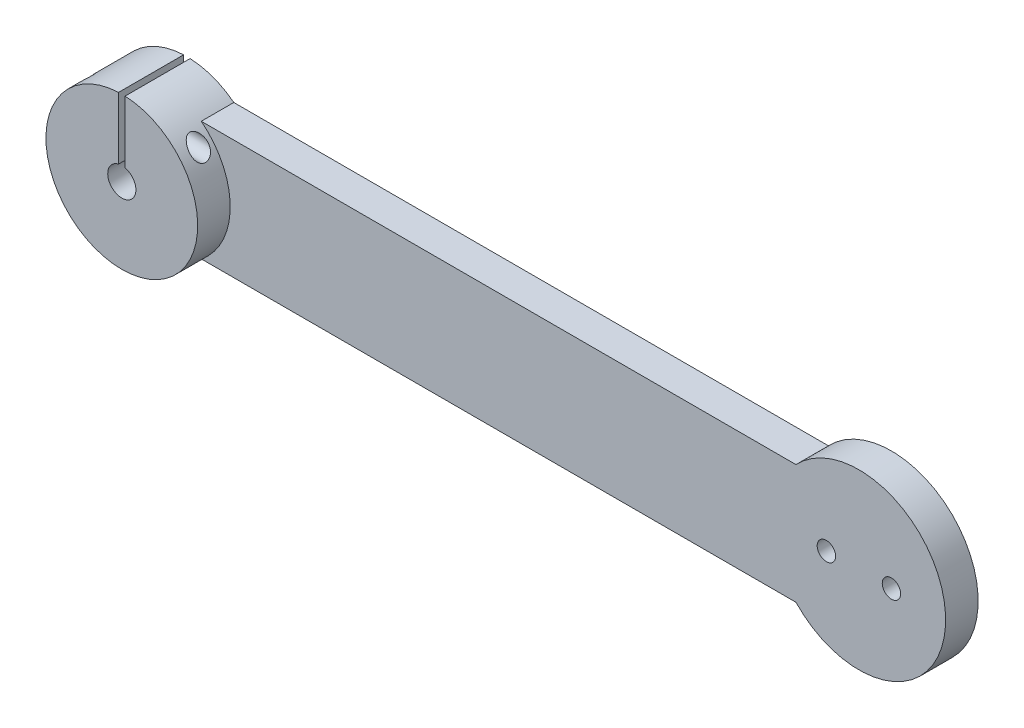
ISO-10303-21;
HEADER;
FILE_DESCRIPTION(('STEP AP214'),'2;1');
FILE_NAME('part.step','',(''),(''),'','','');
FILE_SCHEMA(('AUTOMOTIVE_DESIGN { 1 0 10303 214 1 1 1 1 }'));
ENDSEC;
DATA;
#1=APPLICATION_CONTEXT('core data for automotive mechanical design processes');
#2=APPLICATION_PROTOCOL_DEFINITION('international standard','automotive_design',2000,#1);
#3=PRODUCT_CONTEXT('',#1,'mechanical');
#4=PRODUCT('Part','Part','',(#3));
#5=PRODUCT_RELATED_PRODUCT_CATEGORY('part','',(#4));
#6=PRODUCT_DEFINITION_FORMATION('','',#4);
#7=PRODUCT_DEFINITION_CONTEXT('part definition',#1,'design');
#8=PRODUCT_DEFINITION('design','',#6,#7);
#9=PRODUCT_DEFINITION_SHAPE('','',#8);
#10=(LENGTH_UNIT() NAMED_UNIT(*) SI_UNIT(.MILLI.,.METRE.));
#11=(NAMED_UNIT(*) PLANE_ANGLE_UNIT() SI_UNIT($,.RADIAN.));
#12=(NAMED_UNIT(*) SI_UNIT($,.STERADIAN.) SOLID_ANGLE_UNIT());
#13=UNCERTAINTY_MEASURE_WITH_UNIT(LENGTH_MEASURE(1.E-05),#10,'distance_accuracy_value','');
#14=(GEOMETRIC_REPRESENTATION_CONTEXT(3) GLOBAL_UNCERTAINTY_ASSIGNED_CONTEXT((#13)) GLOBAL_UNIT_ASSIGNED_CONTEXT((#10,
#11,#12)) REPRESENTATION_CONTEXT('',''));
#15=CARTESIAN_POINT('',(0.,0.,0.));
#16=DIRECTION('',(0.,0.,1.));
#17=DIRECTION('',(1.,0.,0.));
#18=AXIS2_PLACEMENT_3D('',#15,#16,#17);
#19=CARTESIAN_POINT('',(0.,0.,0.));
#20=DIRECTION('',(0.,0.,-1.));
#21=DIRECTION('',(-1.,0.,0.));
#22=AXIS2_PLACEMENT_3D('',#19,#20,#21);
#23=PLANE('',#22);
#24=DIRECTION('',(0.,1.,0.));
#25=VECTOR('',#24,1.);
#26=CARTESIAN_POINT('',(-0.6,0.,0.));
#27=LINE('',#26,#25);
#28=CARTESIAN_POINT('',(-0.600000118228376,2.52993670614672,-8.99999999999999E-06));
#29=VERTEX_POINT('',#28);
#30=CARTESIAN_POINT('',(-0.6,13.9871369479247,0.));
#31=VERTEX_POINT('',#30);
#32=EDGE_CURVE('E106',#29,#31,#27,.T.);
#33=ORIENTED_EDGE('',*,*,#32,.F.);
#34=CARTESIAN_POINT('',(-0.60005169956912,2.53026829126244,0.));
#35=CARTESIAN_POINT('',(-0.643668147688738,2.51989298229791,0.));
#36=CARTESIAN_POINT('',(-0.68701076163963,2.50836147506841,0.));
#37=CARTESIAN_POINT('',(-0.773252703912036,2.48299902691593,0.));
#38=CARTESIAN_POINT('',(-0.816148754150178,2.46915693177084,0.));
#39=CARTESIAN_POINT('',(-0.881555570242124,2.4461799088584,0.));
#40=CARTESIAN_POINT('',(-0.904341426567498,2.43781932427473,0.));
#41=CARTESIAN_POINT('',(-0.949786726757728,2.42043838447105,0.));
#42=CARTESIAN_POINT('',(-0.972445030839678,2.41141504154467,0.));
#43=CARTESIAN_POINT('',(-1.01447809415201,2.39401325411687,0.));
#44=CARTESIAN_POINT('',(-1.03388457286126,2.38571131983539,0.));
#45=CARTESIAN_POINT('',(-1.07241652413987,2.36868196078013,0.));
#46=CARTESIAN_POINT('',(-1.09154281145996,2.35995637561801,0.));
#47=CARTESIAN_POINT('',(-1.15131120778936,2.33181861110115,0.));
#48=CARTESIAN_POINT('',(-1.19157119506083,2.31158584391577,0.));
#49=CARTESIAN_POINT('',(-1.27078515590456,2.26914364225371,0.));
#50=CARTESIAN_POINT('',(-1.30974446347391,2.24694414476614,0.));
#51=CARTESIAN_POINT('',(-1.38636211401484,2.20057343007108,0.));
#52=CARTESIAN_POINT('',(-1.42402298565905,2.17640639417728,0.));
#53=CARTESIAN_POINT('',(-1.49804614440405,2.12610649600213,0.));
#54=CARTESIAN_POINT('',(-1.53440751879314,2.09997229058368,0.));
#55=CARTESIAN_POINT('',(-1.60583473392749,2.04574417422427,0.));
#56=CARTESIAN_POINT('',(-1.64089567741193,2.01764381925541,0.));
#57=CARTESIAN_POINT('',(-1.70972877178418,1.959485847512,0.));
#58=CARTESIAN_POINT('',(-1.74349166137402,1.92941724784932,0.));
#59=CARTESIAN_POINT('',(-1.7869433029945,1.88868881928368,0.));
#60=CARTESIAN_POINT('',(-1.7973439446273,1.87878053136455,0.));
#61=CARTESIAN_POINT('',(-1.818016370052,1.85876831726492,0.));
#62=CARTESIAN_POINT('',(-1.82828767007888,1.84866389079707,0.));
#63=CARTESIAN_POINT('',(-1.86043961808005,1.81652362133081,0.));
#64=CARTESIAN_POINT('',(-1.88202377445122,1.79418948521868,0.));
#65=CARTESIAN_POINT('',(-1.92427413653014,1.74890081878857,0.));
#66=CARTESIAN_POINT('',(-1.94494474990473,1.72595039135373,0.));
#67=CARTESIAN_POINT('',(-1.99467203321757,1.66872443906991,0.));
#68=CARTESIAN_POINT('',(-2.02326699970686,1.63404549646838,0.));
#69=CARTESIAN_POINT('',(-2.07849633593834,1.56336269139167,0.));
#70=CARTESIAN_POINT('',(-2.10513740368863,1.52736405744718,0.));
#71=CARTESIAN_POINT('',(-2.15646502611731,1.4540449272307,0.));
#72=CARTESIAN_POINT('',(-2.18115324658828,1.4167255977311,0.));
#73=CARTESIAN_POINT('',(-2.22857992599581,1.34076997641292,0.));
#74=CARTESIAN_POINT('',(-2.25131458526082,1.3021313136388,0.));
#75=CARTESIAN_POINT('',(-2.29695458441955,1.21971993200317,0.));
#76=CARTESIAN_POINT('',(-2.31964062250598,1.1758256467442,0.));
#77=CARTESIAN_POINT('',(-2.36268488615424,1.08646171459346,0.));
#78=CARTESIAN_POINT('',(-2.38302221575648,1.04098201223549,0.));
#79=CARTESIAN_POINT('',(-2.41777719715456,0.957114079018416,0.));
#80=CARTESIAN_POINT('',(-2.43260550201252,0.918895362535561,0.));
#81=CARTESIAN_POINT('',(-2.46036499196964,0.842066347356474,0.));
#82=CARTESIAN_POINT('',(-2.47330834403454,0.803460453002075,0.));
#83=CARTESIAN_POINT('',(-2.49858082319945,0.721726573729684,0.));
#84=CARTESIAN_POINT('',(-2.51071382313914,0.678537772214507,0.));
#85=CARTESIAN_POINT('',(-2.53266441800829,0.591686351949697,0.));
#86=CARTESIAN_POINT('',(-2.54248751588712,0.548025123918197,0.));
#87=CARTESIAN_POINT('',(-2.55982476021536,0.46023075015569,0.));
#88=CARTESIAN_POINT('',(-2.56733809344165,0.416097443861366,0.));
#89=CARTESIAN_POINT('',(-2.58006227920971,0.327359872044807,0.));
#90=CARTESIAN_POINT('',(-2.58526589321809,0.282754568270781,0.));
#91=CARTESIAN_POINT('',(-2.59287513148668,0.198619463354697,0.));
#92=CARTESIAN_POINT('',(-2.59553871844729,0.1591127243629,0.));
#93=CARTESIAN_POINT('',(-2.59910441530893,0.079738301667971,0.));
#94=CARTESIAN_POINT('',(-2.59999381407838,0.0398700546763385,0.));
#95=CARTESIAN_POINT('',(-2.60000789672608,-0.0508966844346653,0.));
#96=CARTESIAN_POINT('',(-2.59857649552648,-0.101796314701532,0.));
#97=CARTESIAN_POINT('',(-2.59276866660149,-0.203031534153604,0.));
#98=CARTESIAN_POINT('',(-2.58841520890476,-0.253368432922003,0.));
#99=CARTESIAN_POINT('',(-2.57741133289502,-0.348015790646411,0.));
#100=CARTESIAN_POINT('',(-2.57107685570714,-0.392363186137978,0.));
#101=CARTESIAN_POINT('',(-2.55609026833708,-0.480610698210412,0.));
#102=CARTESIAN_POINT('',(-2.54744094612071,-0.524511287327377,0.));
#103=CARTESIAN_POINT('',(-2.52783149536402,-0.611864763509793,0.));
#104=CARTESIAN_POINT('',(-2.51686776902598,-0.655316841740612,0.));
#105=CARTESIAN_POINT('',(-2.49263513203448,-0.741776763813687,0.));
#106=CARTESIAN_POINT('',(-2.47935648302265,-0.784781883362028,0.));
#107=CARTESIAN_POINT('',(-2.45547308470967,-0.855604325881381,0.));
#108=CARTESIAN_POINT('',(-2.44548612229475,-0.883631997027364,0.));
#109=CARTESIAN_POINT('',(-2.42451803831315,-0.939497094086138,0.));
#110=CARTESIAN_POINT('',(-2.41353155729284,-0.967332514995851,0.));
#111=CARTESIAN_POINT('',(-2.39612989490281,-1.00936556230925,0.));
#112=CARTESIAN_POINT('',(-2.39004884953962,-1.0237024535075,0.));
#113=CARTESIAN_POINT('',(-2.37765560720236,-1.052223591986,0.));
#114=CARTESIAN_POINT('',(-2.3713441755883,-1.06640817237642,0.));
#115=CARTESIAN_POINT('',(-2.34620785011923,-1.12158685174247,0.));
#116=CARTESIAN_POINT('',(-2.32645471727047,-1.16216374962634,0.));
#117=CARTESIAN_POINT('',(-2.2849705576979,-1.24201062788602,0.));
#118=CARTESIAN_POINT('',(-2.26325088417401,-1.2812865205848,0.));
#119=CARTESIAN_POINT('',(-2.21783831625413,-1.35853685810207,0.));
#120=CARTESIAN_POINT('',(-2.19415099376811,-1.39651457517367,0.));
#121=CARTESIAN_POINT('',(-2.14480916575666,-1.47117058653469,0.));
#122=CARTESIAN_POINT('',(-2.11915463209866,-1.50784886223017,0.));
#123=CARTESIAN_POINT('',(-2.06588445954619,-1.57990906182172,0.));
#124=CARTESIAN_POINT('',(-2.03826357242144,-1.6152871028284,0.));
#125=CARTESIAN_POINT('',(-1.98106371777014,-1.68475299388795,0.));
#126=CARTESIAN_POINT('',(-1.95147481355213,-1.71883267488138,0.));
#127=CARTESIAN_POINT('',(-1.90762873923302,-1.76679754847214,0.));
#128=CARTESIAN_POINT('',(-1.89405563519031,-1.7813135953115,0.));
#129=CARTESIAN_POINT('',(-1.86653393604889,-1.810098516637,0.));
#130=CARTESIAN_POINT('',(-1.85258404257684,-1.82436615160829,0.));
#131=CARTESIAN_POINT('',(-1.82042783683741,-1.85653391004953,0.));
#132=CARTESIAN_POINT('',(-1.80212178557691,-1.87433452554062,0.));
#133=CARTESIAN_POINT('',(-1.76509115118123,-1.90931657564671,0.));
#134=CARTESIAN_POINT('',(-1.74636894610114,-1.92650053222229,0.));
#135=CARTESIAN_POINT('',(-1.69381714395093,-1.97334340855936,0.));
#136=CARTESIAN_POINT('',(-1.65946008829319,-2.0024147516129,0.));
#137=CARTESIAN_POINT('',(-1.58942009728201,-2.05859552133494,0.));
#138=CARTESIAN_POINT('',(-1.55374344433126,-2.085712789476,0.));
#139=CARTESIAN_POINT('',(-1.48106768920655,-2.13799151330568,0.));
#140=CARTESIAN_POINT('',(-1.44407070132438,-2.16315590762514,0.));
#141=CARTESIAN_POINT('',(-1.36875678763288,-2.21153438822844,0.));
#142=CARTESIAN_POINT('',(-1.33043829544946,-2.23474603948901,0.));
#143=CARTESIAN_POINT('',(-1.26777402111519,-2.27050164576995,0.));
#144=CARTESIAN_POINT('',(-1.24378971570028,-2.28368363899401,0.));
#145=CARTESIAN_POINT('',(-1.19533263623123,-2.30932643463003,0.));
#146=CARTESIAN_POINT('',(-1.1708584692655,-2.3217846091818,0.));
#147=CARTESIAN_POINT('',(-1.12142248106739,-2.34597980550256,0.));
#148=CARTESIAN_POINT('',(-1.09645898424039,-2.35771340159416,0.));
#149=CARTESIAN_POINT('',(-1.04604525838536,-2.38046115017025,0.));
#150=CARTESIAN_POINT('',(-1.02059313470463,-2.39147109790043,0.));
#151=CARTESIAN_POINT('',(-0.962208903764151,-2.41566627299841,0.));
#152=CARTESIAN_POINT('',(-0.929172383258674,-2.42860062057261,0.));
#153=CARTESIAN_POINT('',(-0.862808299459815,-2.45305077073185,0.));
#154=CARTESIAN_POINT('',(-0.829483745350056,-2.46457475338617,0.));
#155=CARTESIAN_POINT('',(-0.753223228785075,-2.48921934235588,0.));
#156=CARTESIAN_POINT('',(-0.710149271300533,-2.50191571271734,0.));
#157=CARTESIAN_POINT('',(-0.623527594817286,-2.52499136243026,0.));
#158=CARTESIAN_POINT('',(-0.579981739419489,-2.53537764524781,0.));
#159=CARTESIAN_POINT('',(-0.492417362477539,-2.55383979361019,0.));
#160=CARTESIAN_POINT('',(-0.448398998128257,-2.56191640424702,0.));
#161=CARTESIAN_POINT('',(-0.359891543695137,-2.575765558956,0.));
#162=CARTESIAN_POINT('',(-0.315401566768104,-2.58153242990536,0.));
#163=CARTESIAN_POINT('',(-0.225995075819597,-2.59076348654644,0.));
#164=CARTESIAN_POINT('',(-0.181077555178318,-2.59421790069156,0.));
#165=CARTESIAN_POINT('',(-0.0907740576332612,-2.59884162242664,0.));
#166=CARTESIAN_POINT('',(-0.0453871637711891,-2.59999285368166,0.));
#167=CARTESIAN_POINT('',(0.0453936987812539,-2.60000714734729,0.));
#168=CARTESIAN_POINT('',(0.0907876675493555,-2.59886988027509,0.));
#169=CARTESIAN_POINT('',(0.18112798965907,-2.5942575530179,0.));
#170=CARTESIAN_POINT('',(0.226075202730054,-2.59079949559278,0.));
#171=CARTESIAN_POINT('',(0.31547787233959,-2.58155840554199,0.));
#172=CARTESIAN_POINT('',(0.35993467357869,-2.57578840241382,0.));
#173=CARTESIAN_POINT('',(0.448400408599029,-2.56192917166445,0.));
#174=CARTESIAN_POINT('',(0.492410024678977,-2.55384430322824,0.));
#175=CARTESIAN_POINT('',(0.579981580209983,-2.53536211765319,0.));
#176=CARTESIAN_POINT('',(0.623543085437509,-2.52496274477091,0.));
#177=CARTESIAN_POINT('',(0.710220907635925,-2.50185752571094,0.));
#178=CARTESIAN_POINT('',(0.753335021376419,-2.48914340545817,0.));
#179=CARTESIAN_POINT('',(0.829601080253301,-2.46449175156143,0.));
#180=CARTESIAN_POINT('',(0.862891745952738,-2.45298052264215,0.));
#181=CARTESIAN_POINT('',(0.929205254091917,-2.42856220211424,0.));
#182=CARTESIAN_POINT('',(0.962224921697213,-2.41564647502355,0.));
#183=CARTESIAN_POINT('',(1.02058911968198,-2.39148305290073,0.));
#184=CARTESIAN_POINT('',(1.04603762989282,-2.38048551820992,0.));
#185=CARTESIAN_POINT('',(1.09644978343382,-2.35775389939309,0.));
#186=CARTESIAN_POINT('',(1.12141522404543,-2.34602380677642,0.));
#187=CARTESIAN_POINT('',(1.17086154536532,-2.3218287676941,0.));
#188=CARTESIAN_POINT('',(1.19534398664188,-2.30936701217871,0.));
#189=CARTESIAN_POINT('',(1.24382387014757,-2.28370973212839,0.));
#190=CARTESIAN_POINT('',(1.26782257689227,-2.27051659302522,0.));
#191=CARTESIAN_POINT('',(1.33047851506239,-2.23475328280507,0.));
#192=CARTESIAN_POINT('',(1.36877417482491,-2.21154516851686,0.));
#193=CARTESIAN_POINT('',(1.44406384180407,-2.16316104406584,0.));
#194=CARTESIAN_POINT('',(1.48105869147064,-2.13798634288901,0.));
#195=CARTESIAN_POINT('',(1.55375163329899,-2.08567423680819,0.));
#196=CARTESIAN_POINT('',(1.58944683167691,-2.05853281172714,0.));
#197=CARTESIAN_POINT('',(1.65954556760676,-2.00229105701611,0.));
#198=CARTESIAN_POINT('',(1.69394201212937,-1.97318187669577,0.));
#199=CARTESIAN_POINT('',(1.74650010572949,-1.92633341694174,0.));
#200=CARTESIAN_POINT('',(1.76518979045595,-1.90918232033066,0.));
#201=CARTESIAN_POINT('',(1.80216557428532,-1.87426672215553,0.));
#202=CARTESIAN_POINT('',(1.82044918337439,-1.85649957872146,0.));
#203=CARTESIAN_POINT('',(1.85262399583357,-1.82433636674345,0.));
#204=CARTESIAN_POINT('',(1.86661325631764,-1.81003821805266,0.));
#205=CARTESIAN_POINT('',(1.89421252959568,-1.78118554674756,0.));
#206=CARTESIAN_POINT('',(1.90782378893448,-1.76663221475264,0.));
#207=CARTESIAN_POINT('',(1.95166676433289,-1.71867446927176,0.));
#208=CARTESIAN_POINT('',(1.98121447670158,-1.68463924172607,0.));
#209=CARTESIAN_POINT('',(2.03834660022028,-1.61524221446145,0.));
#210=CARTESIAN_POINT('',(2.06593995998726,-1.57988776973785,0.));
#211=CARTESIAN_POINT('',(2.11916999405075,-1.50785486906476,0.));
#212=CARTESIAN_POINT('',(2.14481085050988,-1.47117950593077,0.));
#213=CARTESIAN_POINT('',(2.19414027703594,-1.3965093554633,0.));
#214=CARTESIAN_POINT('',(2.21782775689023,-1.35851384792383,0.));
#215=CARTESIAN_POINT('',(2.26325559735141,-1.2812078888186,0.));
#216=CARTESIAN_POINT('',(2.2849892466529,-1.24189349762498,0.));
#217=CARTESIAN_POINT('',(2.32651650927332,-1.16194959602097,0.));
#218=CARTESIAN_POINT('',(2.34629764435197,-1.12131358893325,0.));
#219=CARTESIAN_POINT('',(2.37144033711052,-1.06613155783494,0.));
#220=CARTESIAN_POINT('',(2.3777295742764,-1.05200254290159,0.));
#221=CARTESIAN_POINT('',(2.39008312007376,-1.02359205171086,0.));
#222=CARTESIAN_POINT('',(2.39614663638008,-1.009310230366,0.));
#223=CARTESIAN_POINT('',(2.41355937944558,-0.967294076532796,0.));
#224=CARTESIAN_POINT('',(2.42457179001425,-0.939419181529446,0.));
#225=CARTESIAN_POINT('',(2.44558614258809,-0.883465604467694,0.));
#226=CARTESIAN_POINT('',(2.4555932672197,-0.855388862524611,0.));
#227=CARTESIAN_POINT('',(2.47948138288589,-0.784551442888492,0.));
#228=CARTESIAN_POINT('',(2.49274600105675,-0.741580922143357,0.));
#229=CARTESIAN_POINT('',(2.51695378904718,-0.655171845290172,0.));
#230=CARTESIAN_POINT('',(2.52790576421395,-0.611735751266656,0.));
#231=CARTESIAN_POINT('',(2.54749508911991,-0.524395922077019,0.));
#232=CARTESIAN_POINT('',(2.55613505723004,-0.480492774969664,0.));
#233=CARTESIAN_POINT('',(2.57110651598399,-0.392221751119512,0.));
#234=CARTESIAN_POINT('',(2.57743421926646,-0.347853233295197,0.));
#235=CARTESIAN_POINT('',(2.58841694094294,-0.253225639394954,0.));
#236=CARTESIAN_POINT('',(2.5927598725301,-0.202930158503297,0.));
#237=CARTESIAN_POINT('',(2.59856379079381,-0.101756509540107,0.));
#238=CARTESIAN_POINT('',(2.60000062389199,-0.0508769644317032,0.));
#239=CARTESIAN_POINT('',(2.59999951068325,0.0399026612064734,0.));
#240=CARTESIAN_POINT('',(2.59911480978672,0.079803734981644,0.));
#241=CARTESIAN_POINT('',(2.59554712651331,0.159256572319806,0.));
#242=CARTESIAN_POINT('',(2.59287632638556,0.198808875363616,0.));
#243=CARTESIAN_POINT('',(2.58525116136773,0.282959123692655,0.));
#244=CARTESIAN_POINT('',(2.58004198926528,0.327534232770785,0.));
#245=CARTESIAN_POINT('',(2.56730511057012,0.416230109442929,0.));
#246=CARTESIAN_POINT('',(2.55978364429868,0.460351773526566,0.));
#247=CARTESIAN_POINT('',(2.54242856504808,0.548141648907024,0.));
#248=CARTESIAN_POINT('',(2.53259477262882,0.591809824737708,0.));
#249=CARTESIAN_POINT('',(2.5106220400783,0.6786938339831,0.));
#250=CARTESIAN_POINT('',(2.49847663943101,0.721908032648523,0.));
#251=CARTESIAN_POINT('',(2.4718848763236,0.80788507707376,0.));
#252=CARTESIAN_POINT('',(2.45742610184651,0.850644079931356,0.));
#253=CARTESIAN_POINT('',(2.42623198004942,0.935686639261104,0.));
#254=CARTESIAN_POINT('',(2.40948036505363,0.977964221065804,0.));
#255=CARTESIAN_POINT('',(2.37392968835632,1.06144668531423,0.));
#256=CARTESIAN_POINT('',(2.35513924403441,1.10265523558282,0.));
#257=CARTESIAN_POINT('',(2.31557368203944,1.18376637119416,0.));
#258=CARTESIAN_POINT('',(2.29481277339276,1.22367587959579,0.));
#259=CARTESIAN_POINT('',(2.25131585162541,1.30219192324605,0.));
#260=CARTESIAN_POINT('',(2.2285882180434,1.34080309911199,0.));
#261=CARTESIAN_POINT('',(2.18116281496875,1.41672462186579,0.));
#262=CARTESIAN_POINT('',(2.1564677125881,1.45403663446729,0.));
#263=CARTESIAN_POINT('',(2.10511319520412,1.52736284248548,0.));
#264=CARTESIAN_POINT('',(2.07845101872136,1.5633751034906,0.));
#265=CARTESIAN_POINT('',(2.02316836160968,1.63410626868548,0.));
#266=CARTESIAN_POINT('',(1.99454016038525,1.66881913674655,0.));
#267=CARTESIAN_POINT('',(1.93532773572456,1.73695284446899,0.));
#268=CARTESIAN_POINT('',(1.90473142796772,1.77036317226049,0.));
#269=CARTESIAN_POINT('',(1.84176650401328,1.8357308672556,0.));
#270=CARTESIAN_POINT('',(1.80939121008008,1.86768179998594,0.));
#271=CARTESIAN_POINT('',(1.74329297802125,1.92964313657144,0.));
#272=CARTESIAN_POINT('',(1.70958212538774,1.95966642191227,0.));
#273=CARTESIAN_POINT('',(1.64082985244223,2.0177493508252,0.));
#274=CARTESIAN_POINT('',(1.60579689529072,2.04581900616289,0.));
#275=CARTESIAN_POINT('',(1.5344065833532,2.10000039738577,0.));
#276=CARTESIAN_POINT('',(1.49805332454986,2.12611752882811,0.));
#277=CARTESIAN_POINT('',(1.42402633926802,2.17639815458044,0.));
#278=CARTESIAN_POINT('',(1.38635277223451,2.2005618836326,0.));
#279=CARTESIAN_POINT('',(1.30968931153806,2.24694140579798,0.));
#280=CARTESIAN_POINT('',(1.2706962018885,2.26915188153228,0.));
#281=CARTESIAN_POINT('',(1.19139632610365,2.31162936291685,0.));
#282=CARTESIAN_POINT('',(1.15108362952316,2.3318852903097,0.));
#283=CARTESIAN_POINT('',(1.06915795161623,2.3704596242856,0.));
#284=CARTESIAN_POINT('',(1.02753727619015,2.38876167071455,0.));
#285=CARTESIAN_POINT('',(0.943546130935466,2.42319089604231,0.));
#286=CARTESIAN_POINT('',(0.90117817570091,2.4393242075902,0.));
#287=CARTESIAN_POINT('',(0.815961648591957,2.4692630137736,0.));
#288=CARTESIAN_POINT('',(0.773118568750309,2.48308411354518,0.));
#289=CARTESIAN_POINT('',(0.686958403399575,2.50841071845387,0.));
#290=CARTESIAN_POINT('',(0.643644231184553,2.51992614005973,0.));
#291=CARTESIAN_POINT('',(0.600053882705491,2.53028751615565,0.));
#292=B_SPLINE_CURVE_WITH_KNOTS('',3,(#34,#35,#36,#37,#38,#39,#40,#41,#42,#43,#44,#45,#46,#47,
#48,#49,#50,#51,#52,#53,#54,#55,#56,#57,#58,#59,#60,#61,#62,#63,#64,#65,#66,#67,#68,#69,#70,#71,
#72,#73,#74,#75,#76,#77,#78,#79,#80,#81,#82,#83,#84,#85,#86,#87,#88,#89,#90,#91,#92,#93,#94,#95,
#96,#97,#98,#99,#100,#101,#102,#103,#104,#105,#106,#107,#108,#109,#110,#111,#112,#113,#114,#115,
#116,#117,#118,#119,#120,#121,#122,#123,#124,#125,#126,#127,#128,#129,#130,#131,#132,#133,#134,
#135,#136,#137,#138,#139,#140,#141,#142,#143,#144,#145,#146,#147,#148,#149,#150,#151,#152,#153,
#154,#155,#156,#157,#158,#159,#160,#161,#162,#163,#164,#165,#166,#167,#168,#169,#170,#171,#172,
#173,#174,#175,#176,#177,#178,#179,#180,#181,#182,#183,#184,#185,#186,#187,#188,#189,#190,#191,
#192,#193,#194,#195,#196,#197,#198,#199,#200,#201,#202,#203,#204,#205,#206,#207,#208,#209,#210,
#211,#212,#213,#214,#215,#216,#217,#218,#219,#220,#221,#222,#223,#224,#225,#226,#227,#228,#229,
#230,#231,#232,#233,#234,#235,#236,#237,#238,#239,#240,#241,#242,#243,#244,#245,#246,#247,#248,
#249,#250,#251,#252,#253,#254,#255,#256,#257,#258,#259,#260,#261,#262,#263,#264,#265,#266,#267,
#268,#269,#270,#271,#272,#273,#274,#275,#276,#277,#278,#279,#280,#281,#282,#283,#284,#285,#286,
#287,#288,#289,#290,#291),.UNSPECIFIED.,.F.,.F.,(4,2,2,2,2,2,2,2,2,2,2,2,2,2,2,2,2,2,2,2,2,2,2,
2,2,2,2,2,2,2,2,2,2,2,2,2,2,2,2,2,2,2,2,2,2,2,2,2,2,2,2,2,2,2,2,2,2,2,2,2,2,2,2,2,2,2,2,2,2,2,2,
2,2,2,2,2,2,2,2,2,2,2,2,2,2,2,2,2,2,2,2,2,2,2,2,2,2,2,2,2,2,2,2,2,2,2,2,2,2,2,2,2,2,2,2,2,2,2,2,
2,2,2,2,2,2,2,2,2,4),(0.,0.134488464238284,0.269646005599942,0.342452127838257,
0.415609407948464,0.478926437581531,0.54198957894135,0.677097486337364,0.811557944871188,
0.945739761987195,1.08001404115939,1.21475112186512,1.35031755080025,1.39341076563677,
1.43663406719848,1.52979139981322,1.62243474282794,1.75721325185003,1.89150575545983,
2.02568244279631,2.16011445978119,2.30826395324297,2.45764375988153,2.58058547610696,
2.70269465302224,2.83721438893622,2.9714103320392,3.10565346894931,3.24031439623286,
3.35906344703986,3.47866026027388,3.63133327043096,3.78281997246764,3.917151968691,
4.05132289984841,4.18570395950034,4.32066460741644,4.4099110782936,4.49966800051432,
4.5463855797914,4.59296001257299,4.72828120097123,4.86286569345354,4.99708128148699,
5.13129878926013,5.2658890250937,5.40121973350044,5.46083554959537,5.52069286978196,
5.59728302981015,5.67351236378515,5.80846514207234,5.94284213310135,6.07701283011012,
6.21134842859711,6.29344047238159,6.37581399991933,6.45855110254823,6.54173279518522,
6.64813804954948,6.75389353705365,6.88854825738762,7.02278900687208,7.15698640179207,
7.29151141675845,7.42660135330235,7.56274743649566,7.69891312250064,7.8340919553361,
7.96851943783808,8.10269542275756,8.2369910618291,8.37177651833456,8.47742382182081,
8.58376196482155,8.66691881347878,8.74965655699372,8.83205698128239,8.91420287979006,
9.04847430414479,9.182657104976,9.31712237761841,9.4522388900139,9.52832986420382,
9.60480191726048,9.66480716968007,9.72458277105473,9.85973152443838,9.99421498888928,
10.128401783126,10.262662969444,10.3973689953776,10.5328866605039,10.579281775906,
10.6258267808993,10.715722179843,10.8051273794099,10.9399762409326,11.074302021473,
11.208475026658,11.3428668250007,11.4942277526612,11.6468416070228,11.7665362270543,
11.8854226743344,12.0199955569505,12.1542084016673,12.2884316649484,12.4230357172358,
12.5583878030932,12.6947554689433,12.830567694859,12.9654658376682,13.0998151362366,
13.2339853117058,13.3683475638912,13.5032715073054,13.639122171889,13.7755231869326,
13.9108895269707,14.0455013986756,14.179726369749,14.3139351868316,14.4484987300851,
14.5837849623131,14.7201273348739,14.8560756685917,14.9910658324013,15.125462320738),.UNSPECIFIED.);
#293=CARTESIAN_POINT('',(0.600000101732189,2.52994164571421,-8.99999999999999E-06));
#294=VERTEX_POINT('',#293);
#295=EDGE_CURVE('E160',#29,#294,#292,.T.);
#296=ORIENTED_EDGE('',*,*,#295,.T.);
#297=DIRECTION('',(0.,-1.,0.));
#298=VECTOR('',#297,1.);
#299=CARTESIAN_POINT('',(0.6,0.,0.));
#300=LINE('',#299,#298);
#301=CARTESIAN_POINT('',(0.6,13.9871369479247,0.));
#302=VERTEX_POINT('',#301);
#303=EDGE_CURVE('E64',#302,#294,#300,.T.);
#304=ORIENTED_EDGE('',*,*,#303,.F.);
#305=CARTESIAN_POINT('',(0.,0.,0.));
#306=DIRECTION('',(0.,0.,1.));
#307=DIRECTION('',(1.,0.,0.));
#308=AXIS2_PLACEMENT_3D('',#305,#306,#307);
#309=CIRCLE('',#308,14.);
#310=CARTESIAN_POINT('',(8.66025403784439,11.,0.));
#311=VERTEX_POINT('',#310);
#312=EDGE_CURVE('E126',#311,#302,#309,.T.);
#313=ORIENTED_EDGE('',*,*,#312,.F.);
#314=DIRECTION('',(-1.,0.,0.));
#315=VECTOR('',#314,1.);
#316=CARTESIAN_POINT('',(0.,11.,0.));
#317=LINE('',#316,#315);
#318=CARTESIAN_POINT('',(118.381049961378,11.,0.));
#319=VERTEX_POINT('',#318);
#320=EDGE_CURVE('E149',#319,#311,#317,.T.);
#321=ORIENTED_EDGE('',*,*,#320,.F.);
#322=CARTESIAN_POINT('',(130.,0.,0.));
#323=DIRECTION('',(0.,0.,1.));
#324=DIRECTION('',(1.,0.,0.));
#325=AXIS2_PLACEMENT_3D('',#322,#323,#324);
#326=CIRCLE('',#325,16.);
#327=CARTESIAN_POINT('',(118.381049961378,-11.,0.));
#328=VERTEX_POINT('',#327);
#329=EDGE_CURVE('E159',#328,#319,#326,.T.);
#330=ORIENTED_EDGE('',*,*,#329,.F.);
#331=DIRECTION('',(1.,0.,0.));
#332=VECTOR('',#331,1.);
#333=CARTESIAN_POINT('',(0.,-11.,0.));
#334=LINE('',#333,#332);
#335=CARTESIAN_POINT('',(8.66025403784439,-11.,0.));
#336=VERTEX_POINT('',#335);
#337=EDGE_CURVE('E145',#336,#328,#334,.T.);
#338=ORIENTED_EDGE('',*,*,#337,.F.);
#339=EDGE_CURVE('E134',#31,#336,#309,.T.);
#340=ORIENTED_EDGE('',*,*,#339,.F.);
#341=EDGE_LOOP('',(#33,#296,#304,#313,#321,#330,#338,#340));
#342=FACE_BOUND('',#341,.T.);
#343=CARTESIAN_POINT('',(125.7,0.,0.));
#344=CARTESIAN_POINT('',(125.700002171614,0.0280353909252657,0.));
#345=CARTESIAN_POINT('',(125.699331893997,0.0560721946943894,0.));
#346=CARTESIAN_POINT('',(125.696633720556,0.111882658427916,0.));
#347=CARTESIAN_POINT('',(125.694615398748,0.139656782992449,0.));
#348=CARTESIAN_POINT('',(125.689221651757,0.194942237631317,0.));
#349=CARTESIAN_POINT('',(125.685852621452,0.2224541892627,0.));
#350=CARTESIAN_POINT('',(125.677761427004,0.277214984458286,0.));
#351=CARTESIAN_POINT('',(125.673042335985,0.304464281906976,0.));
#352=CARTESIAN_POINT('',(125.662254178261,0.358700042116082,0.));
#353=CARTESIAN_POINT('',(125.656184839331,0.385686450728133,0.));
#354=CARTESIAN_POINT('',(125.642699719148,0.439397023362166,0.));
#355=CARTESIAN_POINT('',(125.635280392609,0.466120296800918,0.));
#356=CARTESIAN_POINT('',(125.619098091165,0.519305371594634,0.));
#357=CARTESIAN_POINT('',(125.610328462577,0.545765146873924,0.));
#358=CARTESIAN_POINT('',(125.591450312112,0.598424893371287,0.));
#359=CARTESIAN_POINT('',(125.581332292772,0.624621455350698,0.));
#360=CARTESIAN_POINT('',(125.559879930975,0.676449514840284,0.));
#361=CARTESIAN_POINT('',(125.548548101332,0.702082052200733,0.));
#362=CARTESIAN_POINT('',(125.524723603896,0.752587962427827,0.));
#363=CARTESIAN_POINT('',(125.512239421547,0.777465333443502,0.));
#364=CARTESIAN_POINT('',(125.486114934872,0.826462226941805,0.));
#365=CARTESIAN_POINT('',(125.47248007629,0.850584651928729,0.));
#366=CARTESIAN_POINT('',(125.444056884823,0.89807269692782,0.));
#367=CARTESIAN_POINT('',(125.429270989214,0.921439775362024,0.));
#368=CARTESIAN_POINT('',(125.398548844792,0.967418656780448,0.));
#369=CARTESIAN_POINT('',(125.382612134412,0.990030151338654,0.));
#370=CARTESIAN_POINT('',(125.349591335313,1.03449978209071,0.));
#371=CARTESIAN_POINT('',(125.332504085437,1.05635557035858,0.));
#372=CARTESIAN_POINT('',(125.297184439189,1.09931552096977,0.));
#373=CARTESIAN_POINT('',(125.278946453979,1.12041508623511,0.));
#374=CARTESIAN_POINT('',(125.241329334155,1.16186621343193,0.));
#375=CARTESIAN_POINT('',(125.221942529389,1.18221080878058,0.));
#376=CARTESIAN_POINT('',(125.182274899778,1.22189784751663,0.));
#377=CARTESIAN_POINT('',(125.161996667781,1.24124288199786,0.));
#378=CARTESIAN_POINT('',(125.120658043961,1.27878713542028,0.));
#379=CARTESIAN_POINT('',(125.099603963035,1.29699329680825,0.));
#380=CARTESIAN_POINT('',(125.056717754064,1.33226308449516,0.));
#381=CARTESIAN_POINT('',(125.034889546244,1.34933147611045,0.));
#382=CARTESIAN_POINT('',(124.990457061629,1.38232763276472,0.));
#383=CARTESIAN_POINT('',(124.967854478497,1.39825767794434,0.));
#384=CARTESIAN_POINT('',(124.921875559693,1.42897976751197,0.));
#385=CARTESIAN_POINT('',(124.898498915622,1.4437713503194,0.));
#386=CARTESIAN_POINT('',(124.850973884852,1.47221941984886,0.));
#387=CARTESIAN_POINT('',(124.826823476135,1.48587252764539,0.));
#388=CARTESIAN_POINT('',(124.777752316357,1.51204610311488,0.));
#389=CARTESIAN_POINT('',(124.75282816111,1.52456018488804,0.));
#390=CARTESIAN_POINT('',(124.702211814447,1.54846058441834,0.));
#391=CARTESIAN_POINT('',(124.676515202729,1.55983753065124,0.));
#392=CARTESIAN_POINT('',(124.624679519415,1.58132342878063,0.));
#393=CARTESIAN_POINT('',(124.598541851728,1.59143576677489,0.));
#394=CARTESIAN_POINT('',(124.545982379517,1.61030252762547,0.));
#395=CARTESIAN_POINT('',(124.519563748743,1.61906577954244,0.));
#396=CARTESIAN_POINT('',(124.466444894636,1.63523897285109,0.));
#397=CARTESIAN_POINT('',(124.439746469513,1.64265481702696,0.));
#398=CARTESIAN_POINT('',(124.386069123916,1.65613571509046,0.));
#399=CARTESIAN_POINT('',(124.359090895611,1.66220352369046,0.));
#400=CARTESIAN_POINT('',(124.304855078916,1.67299166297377,0.));
#401=CARTESIAN_POINT('',(124.277597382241,1.67771144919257,0.));
#402=CARTESIAN_POINT('',(124.222803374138,1.6858069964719,0.));
#403=CARTESIAN_POINT('',(124.195266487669,1.68917886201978,0.));
#404=CARTESIAN_POINT('',(124.139914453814,1.69458137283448,0.));
#405=CARTESIAN_POINT('',(124.11209860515,1.69660481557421,0.));
#406=CARTESIAN_POINT('',(124.056188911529,1.69931586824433,0.));
#407=CARTESIAN_POINT('',(124.028094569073,1.69999312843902,0.));
#408=CARTESIAN_POINT('',(123.971982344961,1.70000685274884,0.));
#409=CARTESIAN_POINT('',(123.943964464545,1.69934698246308,0.));
#410=CARTESIAN_POINT('',(123.88818584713,1.69666395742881,0.));
#411=CARTESIAN_POINT('',(123.860424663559,1.69465017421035,0.));
#412=CARTESIAN_POINT('',(123.805160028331,1.68926455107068,0.));
#413=CARTESIAN_POINT('',(123.777655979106,1.68589885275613,0.));
#414=CARTESIAN_POINT('',(123.722905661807,1.67781214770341,0.));
#415=CARTESIAN_POINT('',(123.695658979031,1.67309395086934,0.));
#416=CARTESIAN_POINT('',(123.641423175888,1.66230574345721,0.));
#417=CARTESIAN_POINT('',(123.614434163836,1.65623518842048,0.));
#418=CARTESIAN_POINT('',(123.560713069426,1.64274573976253,0.));
#419=CARTESIAN_POINT('',(123.533981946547,1.63532302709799,0.));
#420=CARTESIAN_POINT('',(123.480775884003,1.61913198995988,0.));
#421=CARTESIAN_POINT('',(123.45430305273,1.61035674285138,0.));
#422=CARTESIAN_POINT('',(123.401611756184,1.59146571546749,0.));
#423=CARTESIAN_POINT('',(123.375396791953,1.58134018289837,0.));
#424=CARTESIAN_POINT('',(123.323550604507,1.55987964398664,0.));
#425=CARTESIAN_POINT('',(123.297917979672,1.54854802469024,0.));
#426=CARTESIAN_POINT('',(123.24741200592,1.52472368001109,0.));
#427=CARTESIAN_POINT('',(123.222534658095,1.51223944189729,0.));
#428=CARTESIAN_POINT('',(123.173537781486,1.48611491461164,0.));
#429=CARTESIAN_POINT('',(123.149415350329,1.47248007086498,0.));
#430=CARTESIAN_POINT('',(123.101927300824,1.44405689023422,0.));
#431=CARTESIAN_POINT('',(123.078560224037,1.42927099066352,0.));
#432=CARTESIAN_POINT('',(123.032581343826,1.39854884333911,0.));
#433=CARTESIAN_POINT('',(123.009969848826,1.38261213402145,0.));
#434=CARTESIAN_POINT('',(122.965500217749,1.34959133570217,0.));
#435=CARTESIAN_POINT('',(122.9436444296,1.3325040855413,0.));
#436=CARTESIAN_POINT('',(122.900684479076,1.2971844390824,0.));
#437=CARTESIAN_POINT('',(122.879584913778,1.27894645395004,0.));
#438=CARTESIAN_POINT('',(122.838133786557,1.24132933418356,0.));
#439=CARTESIAN_POINT('',(122.817789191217,1.221942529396,0.));
#440=CARTESIAN_POINT('',(122.778102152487,1.18227489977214,0.));
#441=CARTESIAN_POINT('',(122.758757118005,1.16199666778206,0.));
#442=CARTESIAN_POINT('',(122.721212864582,1.12065804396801,0.));
#443=CARTESIAN_POINT('',(122.703006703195,1.09960396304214,0.));
#444=CARTESIAN_POINT('',(122.66773691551,1.05671775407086,0.));
#445=CARTESIAN_POINT('',(122.650668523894,1.03488954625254,0.));
#446=CARTESIAN_POINT('',(122.61767236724,0.990457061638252,0.));
#447=CARTESIAN_POINT('',(122.601742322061,0.96785447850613,0.));
#448=CARTESIAN_POINT('',(122.571020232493,0.921875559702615,0.));
#449=CARTESIAN_POINT('',(122.556228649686,0.898498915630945,0.));
#450=CARTESIAN_POINT('',(122.527780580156,0.850973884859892,0.));
#451=CARTESIAN_POINT('',(122.514127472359,0.826823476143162,0.));
#452=CARTESIAN_POINT('',(122.487953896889,0.777752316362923,0.));
#453=CARTESIAN_POINT('',(122.475439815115,0.752828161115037,0.));
#454=CARTESIAN_POINT('',(122.451539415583,0.702211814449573,0.));
#455=CARTESIAN_POINT('',(122.44016246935,0.676515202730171,0.));
#456=CARTESIAN_POINT('',(122.418676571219,0.624679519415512,0.));
#457=CARTESIAN_POINT('',(122.408564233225,0.598541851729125,0.));
#458=CARTESIAN_POINT('',(122.389697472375,0.54598237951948,0.));
#459=CARTESIAN_POINT('',(122.380934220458,0.519563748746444,0.));
#460=CARTESIAN_POINT('',(122.364761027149,0.466444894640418,0.));
#461=CARTESIAN_POINT('',(122.357345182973,0.439746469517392,0.));
#462=CARTESIAN_POINT('',(122.34386428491,0.38606912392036,0.));
#463=CARTESIAN_POINT('',(122.33779647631,0.359090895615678,0.));
#464=CARTESIAN_POINT('',(122.327008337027,0.304855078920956,0.));
#465=CARTESIAN_POINT('',(122.322288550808,0.277597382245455,0.));
#466=CARTESIAN_POINT('',(122.314193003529,0.222803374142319,0.));
#467=CARTESIAN_POINT('',(122.310821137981,0.195266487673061,0.));
#468=CARTESIAN_POINT('',(122.305418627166,0.139914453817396,0.));
#469=CARTESIAN_POINT('',(122.303395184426,0.112098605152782,0.));
#470=CARTESIAN_POINT('',(122.300684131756,0.0561889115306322,0.));
#471=CARTESIAN_POINT('',(122.300006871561,0.0280945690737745,0.));
#472=CARTESIAN_POINT('',(122.299993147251,-0.0280176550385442,0.));
#473=CARTESIAN_POINT('',(122.300653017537,-0.0560355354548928,0.));
#474=CARTESIAN_POINT('',(122.303336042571,-0.111814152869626,0.));
#475=CARTESIAN_POINT('',(122.305349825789,-0.139575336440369,0.));
#476=CARTESIAN_POINT('',(122.310735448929,-0.194839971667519,0.));
#477=CARTESIAN_POINT('',(122.314101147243,-0.22234402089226,0.));
#478=CARTESIAN_POINT('',(122.322187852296,-0.27709433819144,0.));
#479=CARTESIAN_POINT('',(122.32690604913,-0.304341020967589,0.));
#480=CARTESIAN_POINT('',(122.337694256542,-0.358576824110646,0.));
#481=CARTESIAN_POINT('',(122.343764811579,-0.385565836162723,0.));
#482=CARTESIAN_POINT('',(122.357254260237,-0.439286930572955,0.));
#483=CARTESIAN_POINT('',(122.364676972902,-0.46601805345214,0.));
#484=CARTESIAN_POINT('',(122.38086801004,-0.519224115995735,0.));
#485=CARTESIAN_POINT('',(122.389643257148,-0.545696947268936,0.));
#486=CARTESIAN_POINT('',(122.408534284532,-0.598388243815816,0.));
#487=CARTESIAN_POINT('',(122.418659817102,-0.624603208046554,0.));
#488=CARTESIAN_POINT('',(122.440120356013,-0.676449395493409,0.));
#489=CARTESIAN_POINT('',(122.45145197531,-0.702082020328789,0.));
#490=CARTESIAN_POINT('',(122.475276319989,-0.75258799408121,0.));
#491=CARTESIAN_POINT('',(122.487760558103,-0.777465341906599,0.));
#492=CARTESIAN_POINT('',(122.513885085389,-0.826462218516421,0.));
#493=CARTESIAN_POINT('',(122.527519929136,-0.850584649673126,0.));
#494=CARTESIAN_POINT('',(122.555943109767,-0.898072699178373,0.));
#495=CARTESIAN_POINT('',(122.570729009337,-0.921439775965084,0.));
#496=CARTESIAN_POINT('',(122.601451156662,-0.967418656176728,0.));
#497=CARTESIAN_POINT('',(122.617387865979,-0.990030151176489,0.));
#498=CARTESIAN_POINT('',(122.650408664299,-1.03449978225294,0.));
#499=CARTESIAN_POINT('',(122.667495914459,-1.05635557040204,0.));
#500=CARTESIAN_POINT('',(122.702815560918,-1.09931552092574,0.));
#501=CARTESIAN_POINT('',(122.72105354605,-1.12041508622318,0.));
#502=CARTESIAN_POINT('',(122.758670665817,-1.16186621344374,0.));
#503=CARTESIAN_POINT('',(122.778057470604,-1.18221080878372,0.));
#504=CARTESIAN_POINT('',(122.817725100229,-1.22189784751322,0.));
#505=CARTESIAN_POINT('',(122.83800333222,-1.24124288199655,0.));
#506=CARTESIAN_POINT('',(122.879341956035,-1.27878713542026,0.));
#507=CARTESIAN_POINT('',(122.900396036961,-1.29699329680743,0.));
#508=CARTESIAN_POINT('',(122.943282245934,-1.33226308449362,0.));
#509=CARTESIAN_POINT('',(122.965110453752,-1.34933147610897,0.));
#510=CARTESIAN_POINT('',(123.009542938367,-1.38232763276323,0.));
#511=CARTESIAN_POINT('',(123.032145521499,-1.39825767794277,0.));
#512=CARTESIAN_POINT('',(123.078124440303,-1.42897976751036,0.));
#513=CARTESIAN_POINT('',(123.101501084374,-1.44377135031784,0.));
#514=CARTESIAN_POINT('',(123.149026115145,-1.47221941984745,0.));
#515=CARTESIAN_POINT('',(123.173176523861,-1.48587252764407,0.));
#516=CARTESIAN_POINT('',(123.222247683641,-1.51204610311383,0.));
#517=CARTESIAN_POINT('',(123.247171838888,-1.52456018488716,0.));
#518=CARTESIAN_POINT('',(123.297788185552,-1.54846058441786,0.));
#519=CARTESIAN_POINT('',(123.323484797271,-1.55983753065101,0.));
#520=CARTESIAN_POINT('',(123.375320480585,-1.58132342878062,0.));
#521=CARTESIAN_POINT('',(123.401458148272,-1.59143576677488,0.));
#522=CARTESIAN_POINT('',(123.454017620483,-1.61030252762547,0.));
#523=CARTESIAN_POINT('',(123.480436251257,-1.61906577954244,0.));
#524=CARTESIAN_POINT('',(123.533555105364,-1.63523897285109,0.));
#525=CARTESIAN_POINT('',(123.560253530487,-1.64265481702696,0.));
#526=CARTESIAN_POINT('',(123.613930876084,-1.65613571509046,0.));
#527=CARTESIAN_POINT('',(123.640909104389,-1.66220352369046,0.));
#528=CARTESIAN_POINT('',(123.695144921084,-1.67299166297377,0.));
#529=CARTESIAN_POINT('',(123.722402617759,-1.67771144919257,0.));
#530=CARTESIAN_POINT('',(123.777196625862,-1.6858069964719,0.));
#531=CARTESIAN_POINT('',(123.804733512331,-1.68917886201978,0.));
#532=CARTESIAN_POINT('',(123.860085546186,-1.69458137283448,0.));
#533=CARTESIAN_POINT('',(123.88790139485,-1.69660481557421,0.));
#534=CARTESIAN_POINT('',(123.943811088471,-1.69931586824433,0.));
#535=CARTESIAN_POINT('',(123.971905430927,-1.69999312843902,0.));
#536=CARTESIAN_POINT('',(124.028017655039,-1.70000685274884,0.));
#537=CARTESIAN_POINT('',(124.056035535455,-1.69934698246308,0.));
#538=CARTESIAN_POINT('',(124.111814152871,-1.69666395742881,0.));
#539=CARTESIAN_POINT('',(124.139575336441,-1.69465017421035,0.));
#540=CARTESIAN_POINT('',(124.194839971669,-1.68926455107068,0.));
#541=CARTESIAN_POINT('',(124.222344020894,-1.68589885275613,0.));
#542=CARTESIAN_POINT('',(124.277094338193,-1.67781214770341,0.));
#543=CARTESIAN_POINT('',(124.304341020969,-1.67309395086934,0.));
#544=CARTESIAN_POINT('',(124.358576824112,-1.66230574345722,0.));
#545=CARTESIAN_POINT('',(124.385565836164,-1.65623518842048,0.));
#546=CARTESIAN_POINT('',(124.439286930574,-1.64274573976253,0.));
#547=CARTESIAN_POINT('',(124.466018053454,-1.63532302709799,0.));
#548=CARTESIAN_POINT('',(124.519224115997,-1.61913198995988,0.));
#549=CARTESIAN_POINT('',(124.54569694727,-1.61035674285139,0.));
#550=CARTESIAN_POINT('',(124.598388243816,-1.59146571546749,0.));
#551=CARTESIAN_POINT('',(124.624603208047,-1.58134018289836,0.));
#552=CARTESIAN_POINT('',(124.676449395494,-1.55987964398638,0.));
#553=CARTESIAN_POINT('',(124.702082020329,-1.5485480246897,0.));
#554=CARTESIAN_POINT('',(124.752587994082,-1.52472368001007,0.));
#555=CARTESIAN_POINT('',(124.777465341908,-1.51223944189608,0.));
#556=CARTESIAN_POINT('',(124.826462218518,-1.48611491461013,0.));
#557=CARTESIAN_POINT('',(124.850584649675,-1.47248007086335,0.));
#558=CARTESIAN_POINT('',(124.89807269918,-1.44405689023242,0.));
#559=CARTESIAN_POINT('',(124.921439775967,-1.42927099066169,0.));
#560=CARTESIAN_POINT('',(124.967418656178,-1.39854884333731,0.));
#561=CARTESIAN_POINT('',(124.990030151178,-1.38261213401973,0.));
#562=CARTESIAN_POINT('',(125.034499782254,-1.34959133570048,0.));
#563=CARTESIAN_POINT('',(125.056355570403,-1.33250408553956,0.));
#564=CARTESIAN_POINT('',(125.099315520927,-1.29718443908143,0.));
#565=CARTESIAN_POINT('',(125.120415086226,-1.2789464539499,0.));
#566=CARTESIAN_POINT('',(125.161866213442,-1.24132933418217,0.));
#567=CARTESIAN_POINT('',(125.182210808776,-1.22194252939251,0.));
#568=CARTESIAN_POINT('',(125.221897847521,-1.18227489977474,0.));
#569=CARTESIAN_POINT('',(125.241242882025,-1.16199666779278,0.));
#570=CARTESIAN_POINT('',(125.278787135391,-1.12065804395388,0.));
#571=CARTESIAN_POINT('',(125.2969932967,-1.09960396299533,0.));
#572=CARTESIAN_POINT('',(125.332263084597,-1.05671775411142,0.));
#573=CARTESIAN_POINT('',(125.349331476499,-1.03488954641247,0.));
#574=CARTESIAN_POINT('',(125.38232763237,-0.990457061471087,0.));
#575=CARTESIAN_POINT('',(125.398257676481,-0.96785447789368,0.));
#576=CARTESIAN_POINT('',(125.428979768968,-0.921875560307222,0.));
#577=CARTESIAN_POINT('',(125.443771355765,-0.898498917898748,0.));
#578=CARTESIAN_POINT('',(125.472219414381,-0.850973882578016,0.));
#579=CARTESIAN_POINT('',(125.485872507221,-0.8268234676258,0.));
#580=CARTESIAN_POINT('',(125.512046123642,-0.777752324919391,0.));
#581=CARTESIAN_POINT('',(125.524560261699,-0.752828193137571,0.));
#582=CARTESIAN_POINT('',(125.548460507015,-0.702211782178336,0.));
#583=CARTESIAN_POINT('',(125.559837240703,-0.67651508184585,0.));
#584=CARTESIAN_POINT('',(125.58133134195,-0.624661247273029,0.));
#585=CARTESIAN_POINT('',(125.591451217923,-0.598505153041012,0.));
#586=CARTESIAN_POINT('',(125.610330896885,-0.545914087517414,0.));
#587=CARTESIAN_POINT('',(125.619099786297,-0.519482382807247,0.));
#588=CARTESIAN_POINT('',(125.635281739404,-0.466342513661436,0.));
#589=CARTESIAN_POINT('',(125.642700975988,-0.439636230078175,0.));
#590=CARTESIAN_POINT('',(125.656186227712,-0.385948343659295,0.));
#591=CARTESIAN_POINT('',(125.662255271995,-0.358967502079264,0.));
#592=CARTESIAN_POINT('',(125.673043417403,-0.304731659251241,0.));
#593=CARTESIAN_POINT('',(125.677762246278,-0.277476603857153,0.));
#594=CARTESIAN_POINT('',(125.685853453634,-0.222693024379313,0.));
#595=CARTESIAN_POINT('',(125.689222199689,-0.195163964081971,0.));
#596=CARTESIAN_POINT('',(125.694615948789,-0.139833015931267,0.));
#597=CARTESIAN_POINT('',(125.69663399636,-0.11203045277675,0.));
#598=CARTESIAN_POINT('',(125.699332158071,-0.0561517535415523,0.));
#599=CARTESIAN_POINT('',(125.700002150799,-0.0280751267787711,0.));
#600=CARTESIAN_POINT('',(125.7,0.,0.));
#601=B_SPLINE_CURVE_WITH_KNOTS('',3,(#343,#344,#345,#346,#347,#348,#349,#350,#351,#352,#353,
#354,#355,#356,#357,#358,#359,#360,#361,#362,#363,#364,#365,#366,#367,#368,#369,#370,#371,#372,
#373,#374,#375,#376,#377,#378,#379,#380,#381,#382,#383,#384,#385,#386,#387,#388,#389,#390,#391,
#392,#393,#394,#395,#396,#397,#398,#399,#400,#401,#402,#403,#404,#405,#406,#407,#408,#409,#410,
#411,#412,#413,#414,#415,#416,#417,#418,#419,#420,#421,#422,#423,#424,#425,#426,#427,#428,#429,
#430,#431,#432,#433,#434,#435,#436,#437,#438,#439,#440,#441,#442,#443,#444,#445,#446,#447,#448,
#449,#450,#451,#452,#453,#454,#455,#456,#457,#458,#459,#460,#461,#462,#463,#464,#465,#466,#467,
#468,#469,#470,#471,#472,#473,#474,#475,#476,#477,#478,#479,#480,#481,#482,#483,#484,#485,#486,
#487,#488,#489,#490,#491,#492,#493,#494,#495,#496,#497,#498,#499,#500,#501,#502,#503,#504,#505,
#506,#507,#508,#509,#510,#511,#512,#513,#514,#515,#516,#517,#518,#519,#520,#521,#522,#523,#524,
#525,#526,#527,#528,#529,#530,#531,#532,#533,#534,#535,#536,#537,#538,#539,#540,#541,#542,#543,
#544,#545,#546,#547,#548,#549,#550,#551,#552,#553,#554,#555,#556,#557,#558,#559,#560,#561,#562,
#563,#564,#565,#566,#567,#568,#569,#570,#571,#572,#573,#574,#575,#576,#577,#578,#579,#580,#581,
#582,#583,#584,#585,#586,#587,#588,#589,#590,#591,#592,#593,#594,#595,#596,#597,#598,#599,#600),
.UNSPECIFIED.,.F.,.F.,(4,2,2,2,2,2,2,2,2,2,2,2,2,2,2,2,2,2,2,2,2,2,2,2,2,2,2,2,2,2,2,2,2,2,2,2,
2,2,2,2,2,2,2,2,2,2,2,2,2,2,2,2,2,2,2,2,2,2,2,2,2,2,2,2,2,2,2,2,2,2,2,2,2,2,2,2,2,2,2,2,2,2,2,2,
2,2,2,2,2,2,2,2,2,2,2,2,2,2,2,2,2,2,2,2,2,2,2,2,2,2,2,2,2,2,2,2,2,2,2,2,2,2,2,2,2,2,2,2,4),(0.,
0.0841001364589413,0.167609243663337,0.250727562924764,0.333658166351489,0.41660550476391,
0.499773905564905,0.5833660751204,0.667581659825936,0.751626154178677,0.83509481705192,
0.918188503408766,1.00111079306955,1.08406652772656,1.16726030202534,1.25089496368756,
1.33517017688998,1.419214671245,1.50268333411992,1.58577702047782,1.66869931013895,
1.75165504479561,1.83484881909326,1.91848348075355,2.00275869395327,2.08680318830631,
2.17027185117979,2.25336553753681,2.33628782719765,2.4192435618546,2.50243733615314,
2.58607199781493,2.67034721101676,2.75439170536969,2.83786036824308,2.92095405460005,
3.00387634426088,3.08683207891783,3.17002585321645,3.25366051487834,3.3379357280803,
3.42198022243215,3.50544888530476,3.58854257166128,3.67146486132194,3.75442059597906,
3.8376143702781,3.92124903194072,4.00552424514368,4.08956873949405,4.1730374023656,
4.25613108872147,4.33905337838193,4.42200911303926,4.50520288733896,4.58883754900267,
4.67311276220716,4.75715725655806,4.84062591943,4.9237196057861,5.00664189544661,
5.08959763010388,5.17279140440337,5.25642606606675,5.34070127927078,5.42474577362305,
5.50821443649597,5.59130812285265,5.67423041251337,5.75718614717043,5.84037992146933,
5.92401458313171,6.00828979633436,6.0923342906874,6.17580295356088,6.2588966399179,
6.34181892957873,6.42477466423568,6.50796843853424,6.59160310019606,6.67587831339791,
6.7599228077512,6.84339147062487,6.92648515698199,7.00940744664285,7.09236318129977,
7.1755569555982,7.25919161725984,7.34346683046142,7.42751132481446,7.51097998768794,
7.59407367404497,7.6769959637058,7.75995169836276,7.8431454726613,7.92678013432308,
8.01105534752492,8.09509984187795,8.17856850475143,8.26166219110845,8.34458448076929,
8.42754021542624,8.51073398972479,8.59436865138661,8.67864386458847,8.76268835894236,
8.84615702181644,8.92925070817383,9.01217299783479,9.0951287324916,9.17832250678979,
9.26195716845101,9.34623238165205,9.43027687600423,9.51374553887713,9.5968392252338,
9.67976151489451,9.76271724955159,9.84591102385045,9.92954568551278,10.0138208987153,
10.0979251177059,10.1814363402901,10.2645554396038,10.3474861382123,10.4304335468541,
10.5136026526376,10.5971968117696,10.6814163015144),.UNSPECIFIED.);
#602=CARTESIAN_POINT('',(125.7,0.,0.));
#603=VERTEX_POINT('',#602);
#604=EDGE_CURVE('E417',#603,#603,#601,.T.);
#605=ORIENTED_EDGE('',*,*,#604,.T.);
#606=EDGE_LOOP('',(#605));
#607=FACE_BOUND('',#606,.T.);
#608=CARTESIAN_POINT('',(137.7,0.,0.));
#609=CARTESIAN_POINT('',(137.700002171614,0.0280353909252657,0.));
#610=CARTESIAN_POINT('',(137.699331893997,0.0560721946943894,0.));
#611=CARTESIAN_POINT('',(137.696633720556,0.111882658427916,0.));
#612=CARTESIAN_POINT('',(137.694615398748,0.139656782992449,0.));
#613=CARTESIAN_POINT('',(137.689221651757,0.194942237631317,0.));
#614=CARTESIAN_POINT('',(137.685852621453,0.2224541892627,0.));
#615=CARTESIAN_POINT('',(137.677761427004,0.277214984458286,0.));
#616=CARTESIAN_POINT('',(137.673042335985,0.304464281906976,0.));
#617=CARTESIAN_POINT('',(137.662254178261,0.358700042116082,0.));
#618=CARTESIAN_POINT('',(137.656184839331,0.385686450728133,0.));
#619=CARTESIAN_POINT('',(137.642699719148,0.439397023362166,0.));
#620=CARTESIAN_POINT('',(137.635280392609,0.466120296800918,0.));
#621=CARTESIAN_POINT('',(137.619098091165,0.519305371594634,0.));
#622=CARTESIAN_POINT('',(137.610328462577,0.545765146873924,0.));
#623=CARTESIAN_POINT('',(137.591450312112,0.598424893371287,0.));
#624=CARTESIAN_POINT('',(137.581332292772,0.624621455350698,0.));
#625=CARTESIAN_POINT('',(137.559879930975,0.676449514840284,0.));
#626=CARTESIAN_POINT('',(137.548548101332,0.702082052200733,0.));
#627=CARTESIAN_POINT('',(137.524723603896,0.752587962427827,0.));
#628=CARTESIAN_POINT('',(137.512239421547,0.777465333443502,0.));
#629=CARTESIAN_POINT('',(137.486114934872,0.826462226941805,0.));
#630=CARTESIAN_POINT('',(137.47248007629,0.850584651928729,0.));
#631=CARTESIAN_POINT('',(137.444056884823,0.89807269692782,0.));
#632=CARTESIAN_POINT('',(137.429270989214,0.921439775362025,0.));
#633=CARTESIAN_POINT('',(137.398548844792,0.967418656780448,0.));
#634=CARTESIAN_POINT('',(137.382612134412,0.990030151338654,0.));
#635=CARTESIAN_POINT('',(137.349591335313,1.03449978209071,0.));
#636=CARTESIAN_POINT('',(137.332504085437,1.05635557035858,0.));
#637=CARTESIAN_POINT('',(137.297184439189,1.09931552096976,0.));
#638=CARTESIAN_POINT('',(137.278946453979,1.1204150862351,0.));
#639=CARTESIAN_POINT('',(137.241329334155,1.16186621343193,0.));
#640=CARTESIAN_POINT('',(137.221942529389,1.18221080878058,0.));
#641=CARTESIAN_POINT('',(137.182274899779,1.2218978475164,0.));
#642=CARTESIAN_POINT('',(137.161996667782,1.2412428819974,0.));
#643=CARTESIAN_POINT('',(137.120658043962,1.27878713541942,0.));
#644=CARTESIAN_POINT('',(137.099603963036,1.29699329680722,0.));
#645=CARTESIAN_POINT('',(137.056717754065,1.33226308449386,0.));
#646=CARTESIAN_POINT('',(137.034889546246,1.34933147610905,0.));
#647=CARTESIAN_POINT('',(136.990457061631,1.38232763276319,0.));
#648=CARTESIAN_POINT('',(136.967854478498,1.39825767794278,0.));
#649=CARTESIAN_POINT('',(136.921875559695,1.42897976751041,0.));
#650=CARTESIAN_POINT('',(136.898498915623,1.44377135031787,0.));
#651=CARTESIAN_POINT('',(136.850973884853,1.47221941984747,0.));
#652=CARTESIAN_POINT('',(136.826823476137,1.48587252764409,0.));
#653=CARTESIAN_POINT('',(136.777752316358,1.51204610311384,0.));
#654=CARTESIAN_POINT('',(136.752828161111,1.52456018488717,0.));
#655=CARTESIAN_POINT('',(136.702211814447,1.54846058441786,0.));
#656=CARTESIAN_POINT('',(136.676515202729,1.55983753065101,0.));
#657=CARTESIAN_POINT('',(136.624679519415,1.58132342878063,0.));
#658=CARTESIAN_POINT('',(136.598541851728,1.5914357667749,0.));
#659=CARTESIAN_POINT('',(136.545982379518,1.61030252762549,0.));
#660=CARTESIAN_POINT('',(136.519563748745,1.61906577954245,0.));
#661=CARTESIAN_POINT('',(136.466444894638,1.6352389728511,0.));
#662=CARTESIAN_POINT('',(136.439746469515,1.64265481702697,0.));
#663=CARTESIAN_POINT('',(136.386069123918,1.65613571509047,0.));
#664=CARTESIAN_POINT('',(136.359090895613,1.66220352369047,0.));
#665=CARTESIAN_POINT('',(136.304855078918,1.67299166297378,0.));
#666=CARTESIAN_POINT('',(136.277597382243,1.67771144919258,0.));
#667=CARTESIAN_POINT('',(136.22280337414,1.68580699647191,0.));
#668=CARTESIAN_POINT('',(136.195266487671,1.68917886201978,0.));
#669=CARTESIAN_POINT('',(136.139914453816,1.69458137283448,0.));
#670=CARTESIAN_POINT('',(136.112098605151,1.69660481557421,0.));
#671=CARTESIAN_POINT('',(136.05618891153,1.69931586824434,0.));
#672=CARTESIAN_POINT('',(136.028094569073,1.69999312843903,0.));
#673=CARTESIAN_POINT('',(135.971982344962,1.70000685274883,0.));
#674=CARTESIAN_POINT('',(135.943964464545,1.69934698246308,0.));
#675=CARTESIAN_POINT('',(135.888185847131,1.69666395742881,0.));
#676=CARTESIAN_POINT('',(135.86042466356,1.69465017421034,0.));
#677=CARTESIAN_POINT('',(135.805160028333,1.68926455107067,0.));
#678=CARTESIAN_POINT('',(135.777655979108,1.68589885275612,0.));
#679=CARTESIAN_POINT('',(135.722905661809,1.6778121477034,0.));
#680=CARTESIAN_POINT('',(135.695658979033,1.67309395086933,0.));
#681=CARTESIAN_POINT('',(135.64142317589,1.6623057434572,0.));
#682=CARTESIAN_POINT('',(135.614434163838,1.65623518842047,0.));
#683=CARTESIAN_POINT('',(135.560713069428,1.64274573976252,0.));
#684=CARTESIAN_POINT('',(135.533981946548,1.63532302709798,0.));
#685=CARTESIAN_POINT('',(135.480775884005,1.61913198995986,0.));
#686=CARTESIAN_POINT('',(135.454303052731,1.61035674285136,0.));
#687=CARTESIAN_POINT('',(135.401611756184,1.59146571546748,0.));
#688=CARTESIAN_POINT('',(135.375396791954,1.58134018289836,0.));
#689=CARTESIAN_POINT('',(135.323550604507,1.55987964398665,0.));
#690=CARTESIAN_POINT('',(135.297917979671,1.54854802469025,0.));
#691=CARTESIAN_POINT('',(135.247412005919,1.52472368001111,0.));
#692=CARTESIAN_POINT('',(135.222534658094,1.51223944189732,0.));
#693=CARTESIAN_POINT('',(135.173537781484,1.48611491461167,0.));
#694=CARTESIAN_POINT('',(135.149415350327,1.472480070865,0.));
#695=CARTESIAN_POINT('',(135.101927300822,1.44405689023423,0.));
#696=CARTESIAN_POINT('',(135.078560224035,1.42927099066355,0.));
#697=CARTESIAN_POINT('',(135.032581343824,1.39854884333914,0.));
#698=CARTESIAN_POINT('',(135.009969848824,1.38261213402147,0.));
#699=CARTESIAN_POINT('',(134.965500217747,1.34959133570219,0.));
#700=CARTESIAN_POINT('',(134.943644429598,1.33250408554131,0.));
#701=CARTESIAN_POINT('',(134.900684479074,1.29718443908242,0.));
#702=CARTESIAN_POINT('',(134.879584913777,1.27894645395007,0.));
#703=CARTESIAN_POINT('',(134.838133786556,1.24132933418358,0.));
#704=CARTESIAN_POINT('',(134.817789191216,1.221942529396,0.));
#705=CARTESIAN_POINT('',(134.778102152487,1.18227489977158,0.));
#706=CARTESIAN_POINT('',(134.758757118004,1.16199666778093,0.));
#707=CARTESIAN_POINT('',(134.721212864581,1.12065804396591,0.));
#708=CARTESIAN_POINT('',(134.703006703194,1.09960396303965,0.));
#709=CARTESIAN_POINT('',(134.667736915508,1.05671775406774,0.));
#710=CARTESIAN_POINT('',(134.650668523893,1.03488954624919,0.));
#711=CARTESIAN_POINT('',(134.617672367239,0.990457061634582,0.));
#712=CARTESIAN_POINT('',(134.601742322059,0.967854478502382,0.));
#713=CARTESIAN_POINT('',(134.571020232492,0.921875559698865,0.));
#714=CARTESIAN_POINT('',(134.556228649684,0.898498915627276,0.));
#715=CARTESIAN_POINT('',(134.527780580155,0.850973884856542,0.));
#716=CARTESIAN_POINT('',(134.514127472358,0.826823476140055,0.));
#717=CARTESIAN_POINT('',(134.487953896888,0.777752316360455,0.));
#718=CARTESIAN_POINT('',(134.475439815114,0.752828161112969,0.));
#719=CARTESIAN_POINT('',(134.451539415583,0.702211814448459,0.));
#720=CARTESIAN_POINT('',(134.440162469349,0.676515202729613,0.));
#721=CARTESIAN_POINT('',(134.418676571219,0.624679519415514,0.));
#722=CARTESIAN_POINT('',(134.408564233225,0.59854185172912,0.));
#723=CARTESIAN_POINT('',(134.389697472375,0.545982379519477,0.));
#724=CARTESIAN_POINT('',(134.380934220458,0.519563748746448,0.));
#725=CARTESIAN_POINT('',(134.364761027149,0.466444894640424,0.));
#726=CARTESIAN_POINT('',(134.357345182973,0.43974646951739,0.));
#727=CARTESIAN_POINT('',(134.34386428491,0.386069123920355,0.));
#728=CARTESIAN_POINT('',(134.33779647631,0.359090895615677,0.));
#729=CARTESIAN_POINT('',(134.327008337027,0.304855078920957,0.));
#730=CARTESIAN_POINT('',(134.322288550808,0.277597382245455,0.));
#731=CARTESIAN_POINT('',(134.314193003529,0.222803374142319,0.));
#732=CARTESIAN_POINT('',(134.310821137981,0.195266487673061,0.));
#733=CARTESIAN_POINT('',(134.305418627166,0.139914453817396,0.));
#734=CARTESIAN_POINT('',(134.303395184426,0.112098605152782,0.));
#735=CARTESIAN_POINT('',(134.300684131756,0.0561889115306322,0.));
#736=CARTESIAN_POINT('',(134.300006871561,0.0280945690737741,0.));
#737=CARTESIAN_POINT('',(134.299993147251,-0.028017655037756,0.));
#738=CARTESIAN_POINT('',(134.300653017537,-0.0560355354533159,0.));
#739=CARTESIAN_POINT('',(134.303336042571,-0.111814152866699,0.));
#740=CARTESIAN_POINT('',(134.305349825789,-0.139575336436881,0.));
#741=CARTESIAN_POINT('',(134.310735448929,-0.194839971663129,0.));
#742=CARTESIAN_POINT('',(134.314101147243,-0.222344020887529,0.));
#743=CARTESIAN_POINT('',(134.322187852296,-0.277094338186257,0.));
#744=CARTESIAN_POINT('',(134.32690604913,-0.304341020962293,0.));
#745=CARTESIAN_POINT('',(134.337694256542,-0.35857682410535,0.));
#746=CARTESIAN_POINT('',(134.343764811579,-0.385565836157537,0.));
#747=CARTESIAN_POINT('',(134.357254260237,-0.439286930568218,0.));
#748=CARTESIAN_POINT('',(134.364676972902,-0.466018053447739,0.));
#749=CARTESIAN_POINT('',(134.38086801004,-0.51922411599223,0.));
#750=CARTESIAN_POINT('',(134.389643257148,-0.545696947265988,0.));
#751=CARTESIAN_POINT('',(134.408534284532,-0.598388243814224,0.));
#752=CARTESIAN_POINT('',(134.418659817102,-0.624603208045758,0.));
#753=CARTESIAN_POINT('',(134.440120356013,-0.676449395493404,0.));
#754=CARTESIAN_POINT('',(134.451451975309,-0.702082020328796,0.));
#755=CARTESIAN_POINT('',(134.475276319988,-0.752587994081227,0.));
#756=CARTESIAN_POINT('',(134.487760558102,-0.777465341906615,0.));
#757=CARTESIAN_POINT('',(134.513885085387,-0.826462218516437,0.));
#758=CARTESIAN_POINT('',(134.527519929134,-0.850584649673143,0.));
#759=CARTESIAN_POINT('',(134.555943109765,-0.898072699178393,0.));
#760=CARTESIAN_POINT('',(134.570729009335,-0.921439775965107,0.));
#761=CARTESIAN_POINT('',(134.60145115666,-0.96741865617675,0.));
#762=CARTESIAN_POINT('',(134.617387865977,-0.990030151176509,0.));
#763=CARTESIAN_POINT('',(134.650408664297,-1.03449978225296,0.));
#764=CARTESIAN_POINT('',(134.667495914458,-1.05635557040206,0.));
#765=CARTESIAN_POINT('',(134.702815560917,-1.09931552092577,0.));
#766=CARTESIAN_POINT('',(134.721053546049,-1.12041508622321,0.));
#767=CARTESIAN_POINT('',(134.758670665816,-1.16186621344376,0.));
#768=CARTESIAN_POINT('',(134.778057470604,-1.18221080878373,0.));
#769=CARTESIAN_POINT('',(134.817725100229,-1.22189784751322,0.));
#770=CARTESIAN_POINT('',(134.83800333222,-1.24124288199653,0.));
#771=CARTESIAN_POINT('',(134.879341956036,-1.27878713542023,0.));
#772=CARTESIAN_POINT('',(134.900396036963,-1.29699329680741,0.));
#773=CARTESIAN_POINT('',(134.943282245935,-1.3322630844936,0.));
#774=CARTESIAN_POINT('',(134.965110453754,-1.34933147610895,0.));
#775=CARTESIAN_POINT('',(135.009542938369,-1.38232763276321,0.));
#776=CARTESIAN_POINT('',(135.032145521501,-1.39825767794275,0.));
#777=CARTESIAN_POINT('',(135.078124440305,-1.42897976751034,0.));
#778=CARTESIAN_POINT('',(135.101501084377,-1.44377135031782,0.));
#779=CARTESIAN_POINT('',(135.149026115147,-1.47221941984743,0.));
#780=CARTESIAN_POINT('',(135.173176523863,-1.48587252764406,0.));
#781=CARTESIAN_POINT('',(135.222247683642,-1.51204610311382,0.));
#782=CARTESIAN_POINT('',(135.247171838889,-1.52456018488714,0.));
#783=CARTESIAN_POINT('',(135.297788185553,-1.54846058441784,0.));
#784=CARTESIAN_POINT('',(135.323484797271,-1.559837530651,0.));
#785=CARTESIAN_POINT('',(135.375320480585,-1.58132342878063,0.));
#786=CARTESIAN_POINT('',(135.401458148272,-1.5914357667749,0.));
#787=CARTESIAN_POINT('',(135.454017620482,-1.61030252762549,0.));
#788=CARTESIAN_POINT('',(135.480436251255,-1.61906577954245,0.));
#789=CARTESIAN_POINT('',(135.533555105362,-1.6352389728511,0.));
#790=CARTESIAN_POINT('',(135.560253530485,-1.64265481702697,0.));
#791=CARTESIAN_POINT('',(135.613930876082,-1.65613571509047,0.));
#792=CARTESIAN_POINT('',(135.640909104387,-1.66220352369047,0.));
#793=CARTESIAN_POINT('',(135.695144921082,-1.67299166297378,0.));
#794=CARTESIAN_POINT('',(135.722402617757,-1.67771144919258,0.));
#795=CARTESIAN_POINT('',(135.77719662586,-1.68580699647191,0.));
#796=CARTESIAN_POINT('',(135.804733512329,-1.68917886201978,0.));
#797=CARTESIAN_POINT('',(135.860085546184,-1.69458137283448,0.));
#798=CARTESIAN_POINT('',(135.887901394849,-1.69660481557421,0.));
#799=CARTESIAN_POINT('',(135.94381108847,-1.69931586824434,0.));
#800=CARTESIAN_POINT('',(135.971905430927,-1.69999312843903,0.));
#801=CARTESIAN_POINT('',(136.028017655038,-1.70000685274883,0.));
#802=CARTESIAN_POINT('',(136.056035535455,-1.69934698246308,0.));
#803=CARTESIAN_POINT('',(136.111814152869,-1.69666395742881,0.));
#804=CARTESIAN_POINT('',(136.13957533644,-1.69465017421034,0.));
#805=CARTESIAN_POINT('',(136.194839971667,-1.68926455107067,0.));
#806=CARTESIAN_POINT('',(136.222344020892,-1.68589885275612,0.));
#807=CARTESIAN_POINT('',(136.277094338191,-1.6778121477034,0.));
#808=CARTESIAN_POINT('',(136.304341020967,-1.67309395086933,0.));
#809=CARTESIAN_POINT('',(136.35857682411,-1.66230574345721,0.));
#810=CARTESIAN_POINT('',(136.385565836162,-1.65623518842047,0.));
#811=CARTESIAN_POINT('',(136.439286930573,-1.64274573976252,0.));
#812=CARTESIAN_POINT('',(136.466018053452,-1.63532302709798,0.));
#813=CARTESIAN_POINT('',(136.519224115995,-1.61913198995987,0.));
#814=CARTESIAN_POINT('',(136.545696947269,-1.61035674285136,0.));
#815=CARTESIAN_POINT('',(136.598388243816,-1.59146571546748,0.));
#816=CARTESIAN_POINT('',(136.624603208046,-1.58134018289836,0.));
#817=CARTESIAN_POINT('',(136.676449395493,-1.55987964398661,0.));
#818=CARTESIAN_POINT('',(136.702082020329,-1.54854802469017,0.));
#819=CARTESIAN_POINT('',(136.752587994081,-1.52472368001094,0.));
#820=CARTESIAN_POINT('',(136.777465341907,-1.51223944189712,0.));
#821=CARTESIAN_POINT('',(136.826462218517,-1.48611491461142,0.));
#822=CARTESIAN_POINT('',(136.850584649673,-1.47248007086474,0.));
#823=CARTESIAN_POINT('',(136.898072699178,-1.44405689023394,0.));
#824=CARTESIAN_POINT('',(136.921439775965,-1.42927099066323,0.));
#825=CARTESIAN_POINT('',(136.967418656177,-1.39854884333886,0.));
#826=CARTESIAN_POINT('',(136.990030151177,-1.38261213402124,0.));
#827=CARTESIAN_POINT('',(137.034499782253,-1.34959133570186,0.));
#828=CARTESIAN_POINT('',(137.056355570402,-1.33250408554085,0.));
#829=CARTESIAN_POINT('',(137.099315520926,-1.29718443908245,0.));
#830=CARTESIAN_POINT('',(137.120415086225,-1.27894645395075,0.));
#831=CARTESIAN_POINT('',(137.161866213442,-1.24132933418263,0.));
#832=CARTESIAN_POINT('',(137.182210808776,-1.22194252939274,0.));
#833=CARTESIAN_POINT('',(137.221897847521,-1.18227489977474,0.));
#834=CARTESIAN_POINT('',(137.241242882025,-1.16199666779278,0.));
#835=CARTESIAN_POINT('',(137.278787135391,-1.12065804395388,0.));
#836=CARTESIAN_POINT('',(137.2969932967,-1.09960396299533,0.));
#837=CARTESIAN_POINT('',(137.332263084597,-1.05671775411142,0.));
#838=CARTESIAN_POINT('',(137.349331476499,-1.03488954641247,0.));
#839=CARTESIAN_POINT('',(137.38232763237,-0.990457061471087,0.));
#840=CARTESIAN_POINT('',(137.398257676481,-0.96785447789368,0.));
#841=CARTESIAN_POINT('',(137.428979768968,-0.921875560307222,0.));
#842=CARTESIAN_POINT('',(137.443771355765,-0.898498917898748,0.));
#843=CARTESIAN_POINT('',(137.472219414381,-0.850973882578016,0.));
#844=CARTESIAN_POINT('',(137.485872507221,-0.8268234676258,0.));
#845=CARTESIAN_POINT('',(137.512046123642,-0.777752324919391,0.));
#846=CARTESIAN_POINT('',(137.524560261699,-0.752828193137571,0.));
#847=CARTESIAN_POINT('',(137.548460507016,-0.702211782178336,0.));
#848=CARTESIAN_POINT('',(137.559837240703,-0.67651508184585,0.));
#849=CARTESIAN_POINT('',(137.58133134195,-0.624661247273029,0.));
#850=CARTESIAN_POINT('',(137.591451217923,-0.598505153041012,0.));
#851=CARTESIAN_POINT('',(137.610330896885,-0.545914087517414,0.));
#852=CARTESIAN_POINT('',(137.619099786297,-0.519482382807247,0.));
#853=CARTESIAN_POINT('',(137.635281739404,-0.466342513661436,0.));
#854=CARTESIAN_POINT('',(137.642700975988,-0.439636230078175,0.));
#855=CARTESIAN_POINT('',(137.656186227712,-0.385948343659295,0.));
#856=CARTESIAN_POINT('',(137.662255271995,-0.358967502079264,0.));
#857=CARTESIAN_POINT('',(137.673043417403,-0.304731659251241,0.));
#858=CARTESIAN_POINT('',(137.677762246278,-0.277476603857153,0.));
#859=CARTESIAN_POINT('',(137.685853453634,-0.222693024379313,0.));
#860=CARTESIAN_POINT('',(137.689222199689,-0.195163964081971,0.));
#861=CARTESIAN_POINT('',(137.694615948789,-0.139833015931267,0.));
#862=CARTESIAN_POINT('',(137.69663399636,-0.11203045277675,0.));
#863=CARTESIAN_POINT('',(137.699332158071,-0.0561517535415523,0.));
#864=CARTESIAN_POINT('',(137.700002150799,-0.0280751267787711,0.));
#865=CARTESIAN_POINT('',(137.7,0.,0.));
#866=B_SPLINE_CURVE_WITH_KNOTS('',3,(#608,#609,#610,#611,#612,#613,#614,#615,#616,#617,#618,
#619,#620,#621,#622,#623,#624,#625,#626,#627,#628,#629,#630,#631,#632,#633,#634,#635,#636,#637,
#638,#639,#640,#641,#642,#643,#644,#645,#646,#647,#648,#649,#650,#651,#652,#653,#654,#655,#656,
#657,#658,#659,#660,#661,#662,#663,#664,#665,#666,#667,#668,#669,#670,#671,#672,#673,#674,#675,
#676,#677,#678,#679,#680,#681,#682,#683,#684,#685,#686,#687,#688,#689,#690,#691,#692,#693,#694,
#695,#696,#697,#698,#699,#700,#701,#702,#703,#704,#705,#706,#707,#708,#709,#710,#711,#712,#713,
#714,#715,#716,#717,#718,#719,#720,#721,#722,#723,#724,#725,#726,#727,#728,#729,#730,#731,#732,
#733,#734,#735,#736,#737,#738,#739,#740,#741,#742,#743,#744,#745,#746,#747,#748,#749,#750,#751,
#752,#753,#754,#755,#756,#757,#758,#759,#760,#761,#762,#763,#764,#765,#766,#767,#768,#769,#770,
#771,#772,#773,#774,#775,#776,#777,#778,#779,#780,#781,#782,#783,#784,#785,#786,#787,#788,#789,
#790,#791,#792,#793,#794,#795,#796,#797,#798,#799,#800,#801,#802,#803,#804,#805,#806,#807,#808,
#809,#810,#811,#812,#813,#814,#815,#816,#817,#818,#819,#820,#821,#822,#823,#824,#825,#826,#827,
#828,#829,#830,#831,#832,#833,#834,#835,#836,#837,#838,#839,#840,#841,#842,#843,#844,#845,#846,
#847,#848,#849,#850,#851,#852,#853,#854,#855,#856,#857,#858,#859,#860,#861,#862,#863,#864,#865),
.UNSPECIFIED.,.F.,.F.,(4,2,2,2,2,2,2,2,2,2,2,2,2,2,2,2,2,2,2,2,2,2,2,2,2,2,2,2,2,2,2,2,2,2,2,2,
2,2,2,2,2,2,2,2,2,2,2,2,2,2,2,2,2,2,2,2,2,2,2,2,2,2,2,2,2,2,2,2,2,2,2,2,2,2,2,2,2,2,2,2,2,2,2,2,
2,2,2,2,2,2,2,2,2,2,2,2,2,2,2,2,2,2,2,2,2,2,2,2,2,2,2,2,2,2,2,2,2,2,2,2,2,2,2,2,2,2,2,2,4),(0.,
0.0841001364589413,0.167609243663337,0.250727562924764,0.333658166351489,0.41660550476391,
0.499773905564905,0.5833660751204,0.667581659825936,0.751626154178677,0.83509481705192,
0.918188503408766,1.00111079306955,1.08406652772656,1.16726030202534,1.25089496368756,
1.33517017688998,1.41921467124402,1.50268333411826,1.58577702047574,1.66869931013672,
1.75165504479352,1.83484881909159,1.91848348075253,2.00275869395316,2.08680318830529,
2.1702718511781,2.25336553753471,2.3362878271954,2.4192435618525,2.50243733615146,
2.58607199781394,2.67034721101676,2.75439170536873,2.83786036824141,2.92095405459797,
3.00387634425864,3.08683207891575,3.17002585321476,3.2536605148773,3.33793572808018,
3.42198022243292,3.50544888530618,3.58854257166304,3.67146486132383,3.75442059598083,
3.83761437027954,3.92124903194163,4.00552424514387,4.08956873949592,4.17303740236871,
4.25613108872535,4.33905337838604,4.42200911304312,4.50520288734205,4.58883754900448,
4.67311276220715,4.75715725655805,4.84062591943,4.92371960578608,5.0066418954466,
5.08959763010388,5.17279140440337,5.25642606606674,5.34070127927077,5.42474577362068,
5.50821443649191,5.59130812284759,5.67423041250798,5.75718614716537,5.84037992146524,
5.92401458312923,6.00828979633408,6.09233429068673,6.17580295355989,6.25889663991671,
6.34181892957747,6.42477466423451,6.50796843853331,6.59160310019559,6.67587831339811,
6.7599228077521,6.84339147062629,6.92648515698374,7.00940744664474,7.09236318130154,
7.17555695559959,7.25919161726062,7.3434668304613,7.42751132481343,7.51097998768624,
7.59407367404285,7.67699596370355,7.75995169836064,7.84314547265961,7.92678013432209,
8.01105534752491,8.09509984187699,8.17856850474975,8.26166219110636,8.34458448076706,
8.42754021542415,8.5107339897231,8.59436865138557,8.67864386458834,8.76268835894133,
8.84615702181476,8.92925070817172,9.01217299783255,9.09512873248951,9.17832250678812,
9.26195716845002,9.34623238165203,9.43027687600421,9.51374553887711,9.59683922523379,
9.6797615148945,9.76271724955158,9.84591102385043,9.92954568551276,10.0138208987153,
10.0979251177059,10.1814363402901,10.2645554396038,10.3474861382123,10.4304335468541,
10.5136026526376,10.5971968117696,10.6814163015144),.UNSPECIFIED.);
#867=CARTESIAN_POINT('',(137.7,0.,0.));
#868=VERTEX_POINT('',#867);
#869=EDGE_CURVE('E109',#868,#868,#866,.T.);
#870=ORIENTED_EDGE('',*,*,#869,.T.);
#871=EDGE_LOOP('',(#870));
#872=FACE_BOUND('',#871,.T.);
#873=ADVANCED_FACE('F39',(#342,#607,#872),#23,.T.);
#874=CARTESIAN_POINT('',(0.,-11.,6.));
#875=DIRECTION('',(0.,1.,0.));
#876=DIRECTION('',(0.,0.,1.));
#877=AXIS2_PLACEMENT_3D('',#874,#875,#876);
#878=PLANE('',#877);
#879=DIRECTION('',(0.,0.,-1.));
#880=VECTOR('',#879,1.);
#881=CARTESIAN_POINT('',(118.381049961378,-11.,6.));
#882=LINE('',#881,#880);
#883=CARTESIAN_POINT('',(118.381049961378,-11.,6.));
#884=VERTEX_POINT('',#883);
#885=EDGE_CURVE('E136',#884,#328,#882,.T.);
#886=ORIENTED_EDGE('',*,*,#885,.F.);
#887=DIRECTION('',(1.,0.,0.));
#888=VECTOR('',#887,1.);
#889=CARTESIAN_POINT('',(0.,-11.,6.));
#890=LINE('',#889,#888);
#891=CARTESIAN_POINT('',(8.66025403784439,-11.,6.));
#892=VERTEX_POINT('',#891);
#893=EDGE_CURVE('E144',#892,#884,#890,.T.);
#894=ORIENTED_EDGE('',*,*,#893,.F.);
#895=DIRECTION('',(0.,0.,-1.));
#896=VECTOR('',#895,1.);
#897=CARTESIAN_POINT('',(8.66025403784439,-11.,12.));
#898=LINE('',#897,#896);
#899=EDGE_CURVE('E143',#336,#892,#898,.F.);
#900=ORIENTED_EDGE('',*,*,#899,.F.);
#901=ORIENTED_EDGE('',*,*,#337,.T.);
#902=EDGE_LOOP('',(#886,#894,#900,#901));
#903=FACE_BOUND('',#902,.T.);
#904=ADVANCED_FACE('F41',(#903),#878,.F.);
#905=CARTESIAN_POINT('',(0.,11.,6.));
#906=DIRECTION('',(0.,-1.,0.));
#907=DIRECTION('',(0.,0.,-1.));
#908=AXIS2_PLACEMENT_3D('',#905,#906,#907);
#909=PLANE('',#908);
#910=DIRECTION('',(0.,0.,-1.));
#911=VECTOR('',#910,1.);
#912=CARTESIAN_POINT('',(118.381049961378,11.,6.));
#913=LINE('',#912,#911);
#914=CARTESIAN_POINT('',(118.381049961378,11.,6.));
#915=VERTEX_POINT('',#914);
#916=EDGE_CURVE('E260',#319,#915,#913,.F.);
#917=ORIENTED_EDGE('',*,*,#916,.F.);
#918=ORIENTED_EDGE('',*,*,#320,.T.);
#919=DIRECTION('',(0.,0.,-1.));
#920=VECTOR('',#919,1.);
#921=CARTESIAN_POINT('',(8.66025403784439,11.,12.));
#922=LINE('',#921,#920);
#923=CARTESIAN_POINT('',(8.66025403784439,11.,6.));
#924=VERTEX_POINT('',#923);
#925=EDGE_CURVE('E131',#924,#311,#922,.T.);
#926=ORIENTED_EDGE('',*,*,#925,.F.);
#927=DIRECTION('',(-1.,0.,0.));
#928=VECTOR('',#927,1.);
#929=CARTESIAN_POINT('',(0.,11.,6.));
#930=LINE('',#929,#928);
#931=EDGE_CURVE('E146',#915,#924,#930,.T.);
#932=ORIENTED_EDGE('',*,*,#931,.F.);
#933=EDGE_LOOP('',(#917,#918,#926,#932));
#934=FACE_BOUND('',#933,.T.);
#935=ADVANCED_FACE('F185',(#934),#909,.F.);
#936=CARTESIAN_POINT('',(0.,0.,6.));
#937=DIRECTION('',(0.,0.,-1.));
#938=DIRECTION('',(-1.,0.,0.));
#939=AXIS2_PLACEMENT_3D('',#936,#937,#938);
#940=PLANE('',#939);
#941=CARTESIAN_POINT('',(124.,0.,6.));
#942=DIRECTION('',(0.,0.,-1.));
#943=DIRECTION('',(-1.,0.,0.));
#944=AXIS2_PLACEMENT_3D('',#941,#942,#943);
#945=CIRCLE('',#944,1.70000000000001);
#946=CARTESIAN_POINT('',(122.3,0.,6.));
#947=VERTEX_POINT('',#946);
#948=EDGE_CURVE('E156',#947,#947,#945,.T.);
#949=ORIENTED_EDGE('',*,*,#948,.T.);
#950=EDGE_LOOP('',(#949));
#951=FACE_BOUND('',#950,.T.);
#952=CARTESIAN_POINT('',(136.,0.,6.));
#953=DIRECTION('',(0.,0.,-1.));
#954=DIRECTION('',(-1.,0.,0.));
#955=AXIS2_PLACEMENT_3D('',#952,#953,#954);
#956=CIRCLE('',#955,1.70000000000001);
#957=CARTESIAN_POINT('',(134.3,0.,6.));
#958=VERTEX_POINT('',#957);
#959=EDGE_CURVE('E153',#958,#958,#956,.T.);
#960=ORIENTED_EDGE('',*,*,#959,.T.);
#961=EDGE_LOOP('',(#960));
#962=FACE_BOUND('',#961,.T.);
#963=CARTESIAN_POINT('',(130.,0.,6.));
#964=DIRECTION('',(0.,0.,1.));
#965=DIRECTION('',(1.,0.,0.));
#966=AXIS2_PLACEMENT_3D('',#963,#964,#965);
#967=CIRCLE('',#966,16.);
#968=EDGE_CURVE('E248',#884,#915,#967,.T.);
#969=ORIENTED_EDGE('',*,*,#968,.T.);
#970=ORIENTED_EDGE('',*,*,#931,.T.);
#971=CARTESIAN_POINT('',(0.,0.,6.));
#972=DIRECTION('',(0.,0.,-1.));
#973=DIRECTION('',(-1.,0.,0.));
#974=AXIS2_PLACEMENT_3D('',#971,#972,#973);
#975=CIRCLE('',#974,14.);
#976=EDGE_CURVE('E130',#892,#924,#975,.F.);
#977=ORIENTED_EDGE('',*,*,#976,.F.);
#978=ORIENTED_EDGE('',*,*,#893,.T.);
#979=EDGE_LOOP('',(#969,#970,#977,#978));
#980=FACE_BOUND('',#979,.T.);
#981=ADVANCED_FACE('F179',(#951,#962,#980),#940,.F.);
#982=CARTESIAN_POINT('',(0.,0.,12.));
#983=DIRECTION('',(0.,0.,-1.));
#984=DIRECTION('',(-1.,0.,0.));
#985=AXIS2_PLACEMENT_3D('',#982,#983,#984);
#986=CYLINDRICAL_SURFACE('',#985,14.);
#987=CARTESIAN_POINT('',(-10.7238052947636,9.,6.8));
#988=CARTESIAN_POINT('',(-10.6315978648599,9.10986405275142,6.79999997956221));
#989=CARTESIAN_POINT('',(-10.5376594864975,9.21834091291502,6.81063631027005));
#990=CARTESIAN_POINT('',(-10.3482239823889,9.43051622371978,6.85185194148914));
#991=CARTESIAN_POINT('',(-10.2527226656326,9.53419731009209,6.88249843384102));
#992=CARTESIAN_POINT('',(-10.0469131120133,9.75116642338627,6.969779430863));
#993=CARTESIAN_POINT('',(-9.93673641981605,9.86325427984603,7.02984325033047));
#994=CARTESIAN_POINT('',(-9.77601608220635,10.0217380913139,7.13979091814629));
#995=CARTESIAN_POINT('',(-9.72322681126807,10.0729334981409,7.17972243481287));
#996=CARTESIAN_POINT('',(-9.61993029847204,10.1716280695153,7.26646798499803));
#997=CARTESIAN_POINT('',(-9.56942133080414,10.2191300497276,7.31327669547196));
#998=CARTESIAN_POINT('',(-9.4650273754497,10.3159580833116,7.4210190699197));
#999=CARTESIAN_POINT('',(-9.41162575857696,10.3646447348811,7.48300903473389));
#1000=CARTESIAN_POINT('',(-9.31138533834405,10.4547898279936,7.61678339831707));
#1001=CARTESIAN_POINT('',(-9.26453628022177,10.4962595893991,7.68855213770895));
#1002=CARTESIAN_POINT('',(-9.18961035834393,10.5618649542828,7.82544242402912));
#1003=CARTESIAN_POINT('',(-9.15966407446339,10.5878100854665,7.88865828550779));
#1004=CARTESIAN_POINT('',(-9.1077377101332,10.6325111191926,8.02068531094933));
#1005=CARTESIAN_POINT('',(-9.08574686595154,10.6512767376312,8.08948875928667));
#1006=CARTESIAN_POINT('',(-9.05428835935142,10.6780254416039,8.22068246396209));
#1007=CARTESIAN_POINT('',(-9.04344011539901,10.6872009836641,8.2824940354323));
#1008=CARTESIAN_POINT('',(-9.02989499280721,10.6986485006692,8.40762973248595));
#1009=CARTESIAN_POINT('',(-9.02719311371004,10.7009247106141,8.47095290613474));
#1010=CARTESIAN_POINT('',(-9.03019589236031,10.6983907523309,8.59727014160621));
#1011=CARTESIAN_POINT('',(-9.03590313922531,10.6935784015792,8.66026409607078));
#1012=CARTESIAN_POINT('',(-9.05518746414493,10.6772531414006,8.78413968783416));
#1013=CARTESIAN_POINT('',(-9.06877027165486,10.6657353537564,8.8450197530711));
#1014=CARTESIAN_POINT('',(-9.10703492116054,10.6330940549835,8.97836481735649));
#1015=CARTESIAN_POINT('',(-9.13365784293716,10.6102753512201,9.04985276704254));
#1016=CARTESIAN_POINT('',(-9.19507828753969,10.5570917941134,9.18618341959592));
#1017=CARTESIAN_POINT('',(-9.22989064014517,10.526713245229,9.25101375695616));
#1018=CARTESIAN_POINT('',(-9.32128503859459,10.4459904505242,9.39940752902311));
#1019=CARTESIAN_POINT('',(-9.38087910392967,10.3926122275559,9.47944908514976));
#1020=CARTESIAN_POINT('',(-9.50743394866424,10.2769700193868,9.62609851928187));
#1021=CARTESIAN_POINT('',(-9.57440941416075,10.2146882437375,9.69267884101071));
#1022=CARTESIAN_POINT('',(-9.73986438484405,10.0574644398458,9.8368560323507));
#1023=CARTESIAN_POINT('',(-9.8404094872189,9.95928410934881,9.90855555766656));
#1024=CARTESIAN_POINT('',(-10.0449501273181,9.7529575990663,10.0288290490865));
#1025=CARTESIAN_POINT('',(-10.1489487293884,9.64480240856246,10.0773818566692));
#1026=CARTESIAN_POINT('',(-10.3588245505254,9.41907025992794,10.1518871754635));
#1027=CARTESIAN_POINT('',(-10.4647042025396,9.30136635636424,10.1774496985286));
#1028=CARTESIAN_POINT('',(-10.6736459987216,9.06082716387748,10.203203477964));
#1029=CARTESIAN_POINT('',(-10.776710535,8.93799647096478,10.2034169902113));
#1030=CARTESIAN_POINT('',(-10.9608281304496,8.71080130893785,10.1784561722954));
#1031=CARTESIAN_POINT('',(-11.0427361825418,8.60668018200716,10.1574024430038));
#1032=CARTESIAN_POINT('',(-11.2005665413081,8.40024441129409,10.0943357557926));
#1033=CARTESIAN_POINT('',(-11.2764962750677,8.29792765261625,10.0523492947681));
#1034=CARTESIAN_POINT('',(-11.4067889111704,8.11758535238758,9.95594513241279));
#1035=CARTESIAN_POINT('',(-11.4625419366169,8.03856989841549,9.90526866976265));
#1036=CARTESIAN_POINT('',(-11.5671581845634,7.88728682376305,9.78878583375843));
#1037=CARTESIAN_POINT('',(-11.6160226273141,7.81501800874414,9.72298214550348));
#1038=CARTESIAN_POINT('',(-11.7056573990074,7.68011804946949,9.57607358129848));
#1039=CARTESIAN_POINT('',(-11.7463567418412,7.61757241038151,9.49484553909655));
#1040=CARTESIAN_POINT('',(-11.81747300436,7.50677642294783,9.31916395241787));
#1041=CARTESIAN_POINT('',(-11.8479003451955,7.45851159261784,9.22472395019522));
#1042=CARTESIAN_POINT('',(-11.8934491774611,7.38562412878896,9.04048805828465));
#1043=CARTESIAN_POINT('',(-11.9101612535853,7.35857182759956,8.9520434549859));
#1044=CARTESIAN_POINT('',(-11.9344330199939,7.31914338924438,8.7707454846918));
#1045=CARTESIAN_POINT('',(-11.9419997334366,7.30675599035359,8.67789555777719));
#1046=CARTESIAN_POINT('',(-11.9473852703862,7.29794485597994,8.50109901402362));
#1047=CARTESIAN_POINT('',(-11.9461538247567,7.29996574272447,8.41725386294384));
#1048=CARTESIAN_POINT('',(-11.9361967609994,7.31623521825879,8.25122831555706));
#1049=CARTESIAN_POINT('',(-11.9274728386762,7.33048104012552,8.16904754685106));
#1050=CARTESIAN_POINT('',(-11.9030464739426,7.37007506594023,8.01017711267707));
#1051=CARTESIAN_POINT('',(-11.8874767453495,7.39521200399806,7.93341377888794));
#1052=CARTESIAN_POINT('',(-11.849855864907,7.45534490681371,7.78556778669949));
#1053=CARTESIAN_POINT('',(-11.8278036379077,7.49034250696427,7.7144860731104));
#1054=CARTESIAN_POINT('',(-11.7763805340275,7.57094879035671,7.57553994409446));
#1055=CARTESIAN_POINT('',(-11.7466641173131,7.61704863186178,7.50808991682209));
#1056=CARTESIAN_POINT('',(-11.6814360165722,7.71670903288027,7.38213478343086));
#1057=CARTESIAN_POINT('',(-11.6459224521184,7.77027201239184,7.323632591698));
#1058=CARTESIAN_POINT('',(-11.5653296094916,7.88979954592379,7.20962416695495));
#1059=CARTESIAN_POINT('',(-11.5196136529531,7.95648089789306,7.15532297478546));
#1060=CARTESIAN_POINT('',(-11.4229915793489,8.09458963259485,7.05869893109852));
#1061=CARTESIAN_POINT('',(-11.3720814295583,8.16602068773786,7.01638548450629));
#1062=CARTESIAN_POINT('',(-11.2569620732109,8.32417711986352,6.93719155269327));
#1063=CARTESIAN_POINT('',(-11.1919706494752,8.41142189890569,6.90249303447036));
#1064=CARTESIAN_POINT('',(-11.0577044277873,8.58716507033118,6.84832677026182));
#1065=CARTESIAN_POINT('',(-10.9884316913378,8.67566284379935,6.82885175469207));
#1066=CARTESIAN_POINT('',(-10.8541330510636,8.84296992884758,6.80538389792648));
#1067=CARTESIAN_POINT('',(-10.7894072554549,8.92183604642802,6.80000001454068));
#1068=CARTESIAN_POINT('',(-10.7238052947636,9.,6.8));
#1069=B_SPLINE_CURVE_WITH_KNOTS('',3,(#987,#988,#989,#990,#991,#992,#993,#994,#995,#996,#997,
#998,#999,#1000,#1001,#1002,#1003,#1004,#1005,#1006,#1007,#1008,#1009,#1010,#1011,#1012,#1013,
#1014,#1015,#1016,#1017,#1018,#1019,#1020,#1021,#1022,#1023,#1024,#1025,#1026,#1027,#1028,#1029,
#1030,#1031,#1032,#1033,#1034,#1035,#1036,#1037,#1038,#1039,#1040,#1041,#1042,#1043,#1044,#1045,
#1046,#1047,#1048,#1049,#1050,#1051,#1052,#1053,#1054,#1055,#1056,#1057,#1058,#1059,#1060,#1061,
#1062,#1063,#1064,#1065,#1066,#1067,#1068),.UNSPECIFIED.,.T.,.F.,(4,2,2,2,2,2,2,2,2,2,2,2,2,2,2,
2,2,2,2,2,2,2,2,2,2,2,2,2,2,2,2,2,2,2,2,2,2,2,2,2,4),(0.,0.43000779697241,0.861466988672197,
1.36345690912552,1.61418674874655,1.86472353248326,2.14953311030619,2.43389185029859,
2.65691046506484,2.87962619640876,3.06905091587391,3.25835933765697,3.44772605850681,
3.63723071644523,3.87478993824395,4.11278269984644,4.45042329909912,4.78874823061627,
5.25957185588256,5.73082504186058,6.20992913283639,6.68861257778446,7.08949645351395,
7.48987416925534,7.81611799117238,8.14230394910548,8.47121331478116,8.79978798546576,
9.08015868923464,9.36031394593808,9.6107220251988,9.86107344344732,10.1067719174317,
10.3525111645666,10.612258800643,10.8720908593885,11.1631499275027,11.4544367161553,
11.795762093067,12.1369243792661,12.4428580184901),.UNSPECIFIED.);
#1070=CARTESIAN_POINT('',(-10.7238052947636,9.,6.8));
#1071=VERTEX_POINT('',#1070);
#1072=EDGE_CURVE('E121',#1071,#1071,#1069,.T.);
#1073=ORIENTED_EDGE('',*,*,#1072,.T.);
#1074=EDGE_LOOP('',(#1073));
#1075=FACE_BOUND('',#1074,.T.);
#1076=CARTESIAN_POINT('',(10.7238052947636,9.,6.8));
#1077=CARTESIAN_POINT('',(10.8164517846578,8.88960468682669,6.79999909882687));
#1078=CARTESIAN_POINT('',(10.9074654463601,8.77767249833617,6.81073585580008));
#1079=CARTESIAN_POINT('',(11.083869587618,8.55383590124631,6.8556296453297));
#1080=CARTESIAN_POINT('',(11.1692585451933,8.44193150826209,6.88979298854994));
#1081=CARTESIAN_POINT('',(11.3144153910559,8.24594482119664,6.97349371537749));
#1082=CARTESIAN_POINT('',(11.3757753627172,8.16099712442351,7.01823111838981));
#1083=CARTESIAN_POINT('',(11.4917333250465,7.99688165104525,7.12404435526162));
#1084=CARTESIAN_POINT('',(11.5463409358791,7.91770571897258,7.18509654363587));
#1085=CARTESIAN_POINT('',(11.6394608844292,7.78002563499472,7.31294493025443));
#1086=CARTESIAN_POINT('',(11.6791580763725,7.72020847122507,7.37745879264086));
#1087=CARTESIAN_POINT('',(11.7514032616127,7.60978811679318,7.5175277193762));
#1088=CARTESIAN_POINT('',(11.7839525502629,7.55918325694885,7.5930807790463));
#1089=CARTESIAN_POINT('',(11.840990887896,7.46952420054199,7.75421813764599));
#1090=CARTESIAN_POINT('',(11.86543172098,7.43053923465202,7.83985847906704));
#1091=CARTESIAN_POINT('',(11.9050376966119,7.3669194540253,8.01833191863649));
#1092=CARTESIAN_POINT('',(11.9202081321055,7.34227645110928,8.1111608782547));
#1093=CARTESIAN_POINT('',(11.9395379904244,7.31079559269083,8.29035753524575));
#1094=CARTESIAN_POINT('',(11.9447157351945,7.3023124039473,8.37632953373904));
#1095=CARTESIAN_POINT('',(11.9470366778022,7.29851519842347,8.54865701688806));
#1096=CARTESIAN_POINT('',(11.9441829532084,7.30319613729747,8.6350123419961));
#1097=CARTESIAN_POINT('',(11.9308965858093,7.32487887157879,8.80103831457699));
#1098=CARTESIAN_POINT('',(11.9208566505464,7.34124214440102,8.88082560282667));
#1099=CARTESIAN_POINT('',(11.8939509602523,7.38475318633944,9.03617681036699));
#1100=CARTESIAN_POINT('',(11.8770850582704,7.41190118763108,9.11174063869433));
#1101=CARTESIAN_POINT('',(11.8364371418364,7.47664694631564,9.25897908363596));
#1102=CARTESIAN_POINT('',(11.8124705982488,7.51452214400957,9.33047993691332));
#1103=CARTESIAN_POINT('',(11.7584893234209,7.5987120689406,9.46578933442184));
#1104=CARTESIAN_POINT('',(11.7284727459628,7.64502937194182,9.52959552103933));
#1105=CARTESIAN_POINT('',(11.6599618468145,7.74916297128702,9.65439672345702));
#1106=CARTESIAN_POINT('',(11.6209292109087,7.80765734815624,9.71452777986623));
#1107=CARTESIAN_POINT('',(11.5374327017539,7.930521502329,9.82400823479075));
#1108=CARTESIAN_POINT('',(11.4929662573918,7.99489405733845,9.87335249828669));
#1109=CARTESIAN_POINT('',(11.392368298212,8.13773159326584,9.9679606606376));
#1110=CARTESIAN_POINT('',(11.3354927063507,8.21684650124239,10.0114475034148));
#1111=CARTESIAN_POINT('',(11.2170165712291,8.3778612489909,10.0845424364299));
#1112=CARTESIAN_POINT('',(11.1554132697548,8.45976269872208,10.1141423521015));
#1113=CARTESIAN_POINT('',(11.0163916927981,8.64027978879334,10.1646297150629));
#1114=CARTESIAN_POINT('',(10.9382101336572,8.739081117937,10.1827474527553));
#1115=CARTESIAN_POINT('',(10.7783598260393,8.93549353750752,10.2016429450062));
#1116=CARTESIAN_POINT('',(10.6966887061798,9.0331037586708,10.2024087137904));
#1117=CARTESIAN_POINT('',(10.5152235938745,9.24407797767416,10.1863261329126));
#1118=CARTESIAN_POINT('',(10.4149960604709,9.35681066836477,10.1660206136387));
#1119=CARTESIAN_POINT('',(10.2140507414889,9.57576517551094,10.1035821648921));
#1120=CARTESIAN_POINT('',(10.1133325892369,9.68198089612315,10.0614291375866));
#1121=CARTESIAN_POINT('',(9.92058523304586,9.87926175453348,9.95893042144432));
#1122=CARTESIAN_POINT('',(9.82840717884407,9.9708592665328,9.89989109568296));
#1123=CARTESIAN_POINT('',(9.64946712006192,10.1441205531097,9.7622246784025));
#1124=CARTESIAN_POINT('',(9.56269584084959,10.2258015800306,9.68363235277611));
#1125=CARTESIAN_POINT('',(9.42783214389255,10.3499423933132,9.536088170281));
#1126=CARTESIAN_POINT('',(9.37670508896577,10.3962262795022,9.47312605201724));
#1127=CARTESIAN_POINT('',(9.28134436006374,10.4814457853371,9.33767585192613));
#1128=CARTESIAN_POINT('',(9.23710004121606,10.5203927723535,9.26520280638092));
#1129=CARTESIAN_POINT('',(9.16748337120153,10.5810629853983,9.12811396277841));
#1130=CARTESIAN_POINT('',(9.14010368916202,10.6046901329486,9.06537421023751));
#1131=CARTESIAN_POINT('',(9.09328544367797,10.644863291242,8.93482705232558));
#1132=CARTESIAN_POINT('',(9.07383975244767,10.6614156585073,8.86702426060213));
#1133=CARTESIAN_POINT('',(9.04456740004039,10.6862615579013,8.72716214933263));
#1134=CARTESIAN_POINT('',(9.03483099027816,10.6944776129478,8.65506937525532));
#1135=CARTESIAN_POINT('',(9.0264858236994,10.701522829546,8.50979726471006));
#1136=CARTESIAN_POINT('',(9.02786959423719,10.7003582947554,8.43661869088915));
#1137=CARTESIAN_POINT('',(9.04059647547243,10.6896052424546,8.30214683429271));
#1138=CARTESIAN_POINT('',(9.05053132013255,10.6812077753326,8.24061308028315));
#1139=CARTESIAN_POINT('',(9.07761105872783,10.6582030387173,8.12037563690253));
#1140=CARTESIAN_POINT('',(9.09475963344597,10.6435925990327,8.06167340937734));
#1141=CARTESIAN_POINT('',(9.14231853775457,10.6027968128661,7.92767868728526));
#1142=CARTESIAN_POINT('',(9.17527943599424,10.5743393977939,7.85398850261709));
#1143=CARTESIAN_POINT('',(9.2493209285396,10.5096379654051,7.71454940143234));
#1144=CARTESIAN_POINT('',(9.29041833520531,10.4733778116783,7.64881738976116));
#1145=CARTESIAN_POINT('',(9.39768579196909,10.3774112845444,7.49806388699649));
#1146=CARTESIAN_POINT('',(9.46691754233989,10.3144190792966,7.41732860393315));
#1147=CARTESIAN_POINT('',(9.61225822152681,10.1791177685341,7.27133540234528));
#1148=CARTESIAN_POINT('',(9.68838285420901,10.1067872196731,7.20611411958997));
#1149=CARTESIAN_POINT('',(9.87023390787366,9.92972379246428,7.0710882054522));
#1150=CARTESIAN_POINT('',(9.97741746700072,9.82219091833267,7.00691361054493));
#1151=CARTESIAN_POINT('',(10.193542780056,9.59770513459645,6.90376683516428));
#1152=CARTESIAN_POINT('',(10.3024814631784,9.48076749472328,6.86475469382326));
#1153=CARTESIAN_POINT('',(10.4634017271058,9.30180066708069,6.82592873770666));
#1154=CARTESIAN_POINT('',(10.5159861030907,9.24231477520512,6.81627220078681));
#1155=CARTESIAN_POINT('',(10.6204831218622,9.12204387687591,6.80330729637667));
#1156=CARTESIAN_POINT('',(10.6723955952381,9.06125855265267,6.80000050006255));
#1157=CARTESIAN_POINT('',(10.7238052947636,9.,6.8));
#1158=B_SPLINE_CURVE_WITH_KNOTS('',3,(#1076,#1077,#1078,#1079,#1080,#1081,#1082,#1083,#1084,
#1085,#1086,#1087,#1088,#1089,#1090,#1091,#1092,#1093,#1094,#1095,#1096,#1097,#1098,#1099,#1100,
#1101,#1102,#1103,#1104,#1105,#1106,#1107,#1108,#1109,#1110,#1111,#1112,#1113,#1114,#1115,#1116,
#1117,#1118,#1119,#1120,#1121,#1122,#1123,#1124,#1125,#1126,#1127,#1128,#1129,#1130,#1131,#1132,
#1133,#1134,#1135,#1136,#1137,#1138,#1139,#1140,#1141,#1142,#1143,#1144,#1145,#1146,#1147,#1148,
#1149,#1150,#1151,#1152,#1153,#1154,#1155,#1156,#1157),.UNSPECIFIED.,.T.,.F.,(4,2,2,2,2,2,2,2,2,
2,2,2,2,2,2,2,2,2,2,2,2,2,2,2,2,2,2,2,2,2,2,2,2,2,2,2,2,2,2,2,4),(0.,0.432103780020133,
0.864324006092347,1.20483761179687,1.54486035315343,1.83321787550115,2.12152309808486,
2.41151318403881,2.70133754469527,2.95963266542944,3.21782882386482,3.46289765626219,
3.70797176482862,3.96007657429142,4.21225843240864,4.48875085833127,4.76537462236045,
5.08428806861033,5.40338900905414,5.78384858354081,6.1645709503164,6.61939173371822,
7.0746316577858,7.50132867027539,7.92727235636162,8.20663622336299,8.48556363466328,
8.70201514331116,8.91827176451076,9.13652034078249,9.35462226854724,9.54246744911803,
9.73040859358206,9.98576625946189,10.241657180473,10.6104570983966,10.9801194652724,
11.4721536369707,11.9634044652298,12.2031203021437,12.4428954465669),.UNSPECIFIED.);
#1159=CARTESIAN_POINT('',(10.7238052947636,9.,6.8));
#1160=VERTEX_POINT('',#1159);
#1161=EDGE_CURVE('E284',#1160,#1160,#1158,.T.);
#1162=ORIENTED_EDGE('',*,*,#1161,.T.);
#1163=EDGE_LOOP('',(#1162));
#1164=FACE_BOUND('',#1163,.T.);
#1165=CARTESIAN_POINT('',(0.,0.,12.));
#1166=DIRECTION('',(0.,0.,1.));
#1167=DIRECTION('',(1.,0.,0.));
#1168=AXIS2_PLACEMENT_3D('',#1165,#1166,#1167);
#1169=CIRCLE('',#1168,14.);
#1170=CARTESIAN_POINT('',(-0.6,13.9871369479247,12.));
#1171=VERTEX_POINT('',#1170);
#1172=CARTESIAN_POINT('',(0.6,13.9871369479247,12.));
#1173=VERTEX_POINT('',#1172);
#1174=EDGE_CURVE('E117',#1171,#1173,#1169,.T.);
#1175=ORIENTED_EDGE('',*,*,#1174,.F.);
#1176=DIRECTION('',(0.,0.,-1.));
#1177=VECTOR('',#1176,1.);
#1178=CARTESIAN_POINT('',(-0.6,13.9871369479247,12.));
#1179=LINE('',#1178,#1177);
#1180=EDGE_CURVE('E103',#1171,#31,#1179,.T.);
#1181=ORIENTED_EDGE('',*,*,#1180,.T.);
#1182=ORIENTED_EDGE('',*,*,#339,.T.);
#1183=ORIENTED_EDGE('',*,*,#899,.T.);
#1184=ORIENTED_EDGE('',*,*,#976,.T.);
#1185=ORIENTED_EDGE('',*,*,#925,.T.);
#1186=ORIENTED_EDGE('',*,*,#312,.T.);
#1187=DIRECTION('',(0.,0.,-1.));
#1188=VECTOR('',#1187,1.);
#1189=CARTESIAN_POINT('',(0.6,13.9871369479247,12.));
#1190=LINE('',#1189,#1188);
#1191=EDGE_CURVE('E127',#302,#1173,#1190,.F.);
#1192=ORIENTED_EDGE('',*,*,#1191,.T.);
#1193=EDGE_LOOP('',(#1175,#1181,#1182,#1183,#1184,#1185,#1186,#1192));
#1194=FACE_BOUND('',#1193,.T.);
#1195=ADVANCED_FACE('F123',(#1075,#1164,#1194),#986,.T.);
#1196=CARTESIAN_POINT('',(0.,0.,12.));
#1197=DIRECTION('',(0.,0.,1.));
#1198=DIRECTION('',(1.,0.,0.));
#1199=AXIS2_PLACEMENT_3D('',#1196,#1197,#1198);
#1200=PLANE('',#1199);
#1201=DIRECTION('',(0.,-1.,0.));
#1202=VECTOR('',#1201,1.);
#1203=CARTESIAN_POINT('',(-0.6,2.2,12.));
#1204=LINE('',#1203,#1202);
#1205=CARTESIAN_POINT('',(-0.6,2.5298221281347,12.));
#1206=VERTEX_POINT('',#1205);
#1207=EDGE_CURVE('E57',#1171,#1206,#1204,.T.);
#1208=ORIENTED_EDGE('',*,*,#1207,.F.);
#1209=ORIENTED_EDGE('',*,*,#1174,.T.);
#1210=DIRECTION('',(0.,1.,0.));
#1211=VECTOR('',#1210,1.);
#1212=CARTESIAN_POINT('',(0.6,2.2,12.));
#1213=LINE('',#1212,#1211);
#1214=CARTESIAN_POINT('',(0.6,2.5298221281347,12.));
#1215=VERTEX_POINT('',#1214);
#1216=EDGE_CURVE('E120',#1215,#1173,#1213,.T.);
#1217=ORIENTED_EDGE('',*,*,#1216,.F.);
#1218=CARTESIAN_POINT('',(0.,0.,12.));
#1219=DIRECTION('',(0.,0.,1.));
#1220=DIRECTION('',(1.,0.,0.));
#1221=AXIS2_PLACEMENT_3D('',#1218,#1219,#1220);
#1222=CIRCLE('',#1221,2.6);
#1223=EDGE_CURVE('E118',#1206,#1215,#1222,.T.);
#1224=ORIENTED_EDGE('',*,*,#1223,.F.);
#1225=EDGE_LOOP('',(#1208,#1209,#1217,#1224));
#1226=FACE_BOUND('',#1225,.T.);
#1227=ADVANCED_FACE('F113',(#1226),#1200,.T.);
#1228=CARTESIAN_POINT('',(130.,0.,6.));
#1229=DIRECTION('',(0.,0.,-1.));
#1230=DIRECTION('',(-1.,0.,0.));
#1231=AXIS2_PLACEMENT_3D('',#1228,#1229,#1230);
#1232=CYLINDRICAL_SURFACE('',#1231,16.);
#1233=ORIENTED_EDGE('',*,*,#968,.F.);
#1234=ORIENTED_EDGE('',*,*,#885,.T.);
#1235=ORIENTED_EDGE('',*,*,#329,.T.);
#1236=ORIENTED_EDGE('',*,*,#916,.T.);
#1237=EDGE_LOOP('',(#1233,#1234,#1235,#1236));
#1238=FACE_BOUND('',#1237,.T.);
#1239=ADVANCED_FACE('F226',(#1238),#1232,.T.);
#1240=CARTESIAN_POINT('',(0.,0.,-1.2E-05));
#1241=DIRECTION('',(0.,0.,1.));
#1242=DIRECTION('',(1.,0.,0.));
#1243=AXIS2_PLACEMENT_3D('',#1240,#1241,#1242);
#1244=CYLINDRICAL_SURFACE('',#1243,2.6);
#1245=ORIENTED_EDGE('',*,*,#295,.F.);
#1246=DIRECTION('',(0.,0.,1.));
#1247=VECTOR('',#1246,1.);
#1248=CARTESIAN_POINT('',(-0.6,2.5298221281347,-1.2E-05));
#1249=LINE('',#1248,#1247);
#1250=EDGE_CURVE('E11',#29,#1206,#1249,.T.);
#1251=ORIENTED_EDGE('',*,*,#1250,.T.);
#1252=ORIENTED_EDGE('',*,*,#1223,.T.);
#1253=DIRECTION('',(0.,0.,1.));
#1254=VECTOR('',#1253,1.);
#1255=CARTESIAN_POINT('',(0.6,2.5298221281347,-1.2E-05));
#1256=LINE('',#1255,#1254);
#1257=EDGE_CURVE('E48',#1215,#294,#1256,.F.);
#1258=ORIENTED_EDGE('',*,*,#1257,.T.);
#1259=EDGE_LOOP('',(#1245,#1251,#1252,#1258));
#1260=FACE_BOUND('',#1259,.T.);
#1261=ADVANCED_FACE('F214',(#1260),#1244,.F.);
#1262=CARTESIAN_POINT('',(136.,0.,-1.2E-05));
#1263=DIRECTION('',(0.,0.,1.));
#1264=DIRECTION('',(1.,0.,0.));
#1265=AXIS2_PLACEMENT_3D('',#1262,#1263,#1264);
#1266=CYLINDRICAL_SURFACE('',#1265,1.70000000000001);
#1267=ORIENTED_EDGE('',*,*,#869,.F.);
#1268=EDGE_LOOP('',(#1267));
#1269=FACE_BOUND('',#1268,.T.);
#1270=ORIENTED_EDGE('',*,*,#959,.F.);
#1271=EDGE_LOOP('',(#1270));
#1272=FACE_BOUND('',#1271,.T.);
#1273=ADVANCED_FACE('F223',(#1269,#1272),#1266,.F.);
#1274=CARTESIAN_POINT('',(124.,0.,-1.2E-05));
#1275=DIRECTION('',(0.,0.,1.));
#1276=DIRECTION('',(1.,0.,0.));
#1277=AXIS2_PLACEMENT_3D('',#1274,#1275,#1276);
#1278=CYLINDRICAL_SURFACE('',#1277,1.70000000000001);
#1279=ORIENTED_EDGE('',*,*,#604,.F.);
#1280=EDGE_LOOP('',(#1279));
#1281=FACE_BOUND('',#1280,.T.);
#1282=ORIENTED_EDGE('',*,*,#948,.F.);
#1283=EDGE_LOOP('',(#1282));
#1284=FACE_BOUND('',#1283,.T.);
#1285=ADVANCED_FACE('F229',(#1281,#1284),#1278,.F.);
#1286=CARTESIAN_POINT('',(0.6,2.2,-0.0999702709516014));
#1287=DIRECTION('',(1.,0.,0.));
#1288=DIRECTION('',(0.,0.,-1.));
#1289=AXIS2_PLACEMENT_3D('',#1286,#1287,#1288);
#1290=PLANE('',#1289);
#1291=CARTESIAN_POINT('',(0.6,9.,8.5));
#1292=DIRECTION('',(1.,0.,0.));
#1293=DIRECTION('',(0.,0.,-1.));
#1294=AXIS2_PLACEMENT_3D('',#1291,#1292,#1293);
#1295=CIRCLE('',#1294,1.7);
#1296=CARTESIAN_POINT('',(0.6,9.,6.8));
#1297=VERTEX_POINT('',#1296);
#1298=EDGE_CURVE('E310',#1297,#1297,#1295,.T.);
#1299=ORIENTED_EDGE('',*,*,#1298,.T.);
#1300=EDGE_LOOP('',(#1299));
#1301=FACE_BOUND('',#1300,.T.);
#1302=ORIENTED_EDGE('',*,*,#303,.T.);
#1303=ORIENTED_EDGE('',*,*,#1257,.F.);
#1304=ORIENTED_EDGE('',*,*,#1216,.T.);
#1305=ORIENTED_EDGE('',*,*,#1191,.F.);
#1306=EDGE_LOOP('',(#1302,#1303,#1304,#1305));
#1307=FACE_BOUND('',#1306,.T.);
#1308=ADVANCED_FACE('F235',(#1301,#1307),#1290,.F.);
#1309=CARTESIAN_POINT('',(-0.6,2.2,-0.0999702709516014));
#1310=DIRECTION('',(-1.,0.,0.));
#1311=DIRECTION('',(0.,0.,1.));
#1312=AXIS2_PLACEMENT_3D('',#1309,#1310,#1311);
#1313=PLANE('',#1312);
#1314=CARTESIAN_POINT('',(-0.6,9.,8.5));
#1315=DIRECTION('',(-1.,0.,0.));
#1316=DIRECTION('',(0.,0.,1.));
#1317=AXIS2_PLACEMENT_3D('',#1314,#1315,#1316);
#1318=CIRCLE('',#1317,1.7);
#1319=CARTESIAN_POINT('',(-0.6,9.,10.2));
#1320=VERTEX_POINT('',#1319);
#1321=EDGE_CURVE('E43',#1320,#1320,#1318,.T.);
#1322=ORIENTED_EDGE('',*,*,#1321,.T.);
#1323=EDGE_LOOP('',(#1322));
#1324=FACE_BOUND('',#1323,.T.);
#1325=ORIENTED_EDGE('',*,*,#1207,.T.);
#1326=ORIENTED_EDGE('',*,*,#1250,.F.);
#1327=ORIENTED_EDGE('',*,*,#32,.T.);
#1328=ORIENTED_EDGE('',*,*,#1180,.F.);
#1329=EDGE_LOOP('',(#1325,#1326,#1327,#1328));
#1330=FACE_BOUND('',#1329,.T.);
#1331=ADVANCED_FACE('F102',(#1324,#1330),#1313,.F.);
#1332=CARTESIAN_POINT('',(-14.,9.,8.5));
#1333=DIRECTION('',(1.,0.,0.));
#1334=DIRECTION('',(0.,0.,-1.));
#1335=AXIS2_PLACEMENT_3D('',#1332,#1333,#1334);
#1336=CYLINDRICAL_SURFACE('',#1335,1.7);
#1337=ORIENTED_EDGE('',*,*,#1321,.F.);
#1338=EDGE_LOOP('',(#1337));
#1339=FACE_BOUND('',#1338,.T.);
#1340=ORIENTED_EDGE('',*,*,#1072,.F.);
#1341=EDGE_LOOP('',(#1340));
#1342=FACE_BOUND('',#1341,.T.);
#1343=ADVANCED_FACE('F293',(#1339,#1342),#1336,.F.);
#1344=ORIENTED_EDGE('',*,*,#1298,.F.);
#1345=EDGE_LOOP('',(#1344));
#1346=FACE_BOUND('',#1345,.T.);
#1347=ORIENTED_EDGE('',*,*,#1161,.F.);
#1348=EDGE_LOOP('',(#1347));
#1349=FACE_BOUND('',#1348,.T.);
#1350=ADVANCED_FACE('F299',(#1346,#1349),#1336,.F.);
#1351=CLOSED_SHELL('',(#873,#904,#935,#981,#1195,#1227,#1239,#1261,#1273,#1285,#1308,#1331,
#1343,#1350));
#1352=MANIFOLD_SOLID_BREP('B2',#1351);
#1353=ADVANCED_BREP_SHAPE_REPRESENTATION('',(#18,#1352),#14);
#1354=SHAPE_DEFINITION_REPRESENTATION(#9,#1353);
ENDSEC;
END-ISO-10303-21;
